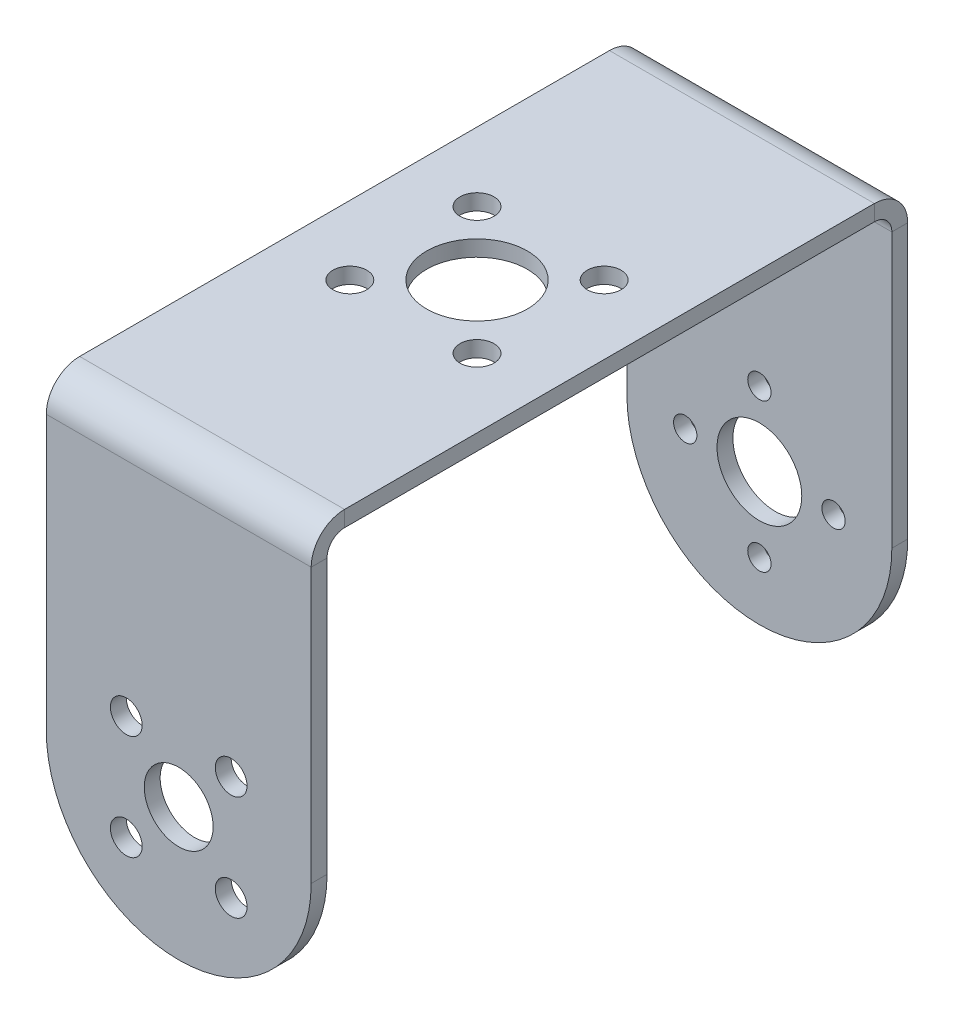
ISO-10303-21;
HEADER;
FILE_DESCRIPTION(('STEP AP214'),'2;1');
FILE_NAME('part.step','',(''),(''),'','','');
FILE_SCHEMA(('AUTOMOTIVE_DESIGN { 1 0 10303 214 1 1 1 1 }'));
ENDSEC;
DATA;
#1=APPLICATION_CONTEXT('core data for automotive mechanical design processes');
#2=APPLICATION_PROTOCOL_DEFINITION('international standard','automotive_design',2000,#1);
#3=PRODUCT_CONTEXT('',#1,'mechanical');
#4=PRODUCT('Part','Part','',(#3));
#5=PRODUCT_RELATED_PRODUCT_CATEGORY('part','',(#4));
#6=PRODUCT_DEFINITION_FORMATION('','',#4);
#7=PRODUCT_DEFINITION_CONTEXT('part definition',#1,'design');
#8=PRODUCT_DEFINITION('design','',#6,#7);
#9=PRODUCT_DEFINITION_SHAPE('','',#8);
#10=(LENGTH_UNIT() NAMED_UNIT(*) SI_UNIT(.MILLI.,.METRE.));
#11=(NAMED_UNIT(*) PLANE_ANGLE_UNIT() SI_UNIT($,.RADIAN.));
#12=(NAMED_UNIT(*) SI_UNIT($,.STERADIAN.) SOLID_ANGLE_UNIT());
#13=UNCERTAINTY_MEASURE_WITH_UNIT(LENGTH_MEASURE(1.E-05),#10,'distance_accuracy_value','');
#14=(GEOMETRIC_REPRESENTATION_CONTEXT(3) GLOBAL_UNCERTAINTY_ASSIGNED_CONTEXT((#13)) GLOBAL_UNIT_ASSIGNED_CONTEXT((#10,
#11,#12)) REPRESENTATION_CONTEXT('',''));
#15=CARTESIAN_POINT('',(0.,0.,0.));
#16=DIRECTION('',(0.,0.,1.));
#17=DIRECTION('',(1.,0.,0.));
#18=AXIS2_PLACEMENT_3D('',#15,#16,#17);
#19=CARTESIAN_POINT('',(0.,-1.5,0.));
#20=DIRECTION('',(0.,1.,0.));
#21=DIRECTION('',(0.,0.,1.));
#22=AXIS2_PLACEMENT_3D('',#19,#20,#21);
#23=PLANE('',#22);
#24=CARTESIAN_POINT('',(6.,-1.5,-6.));
#25=DIRECTION('',(0.,1.,0.));
#26=DIRECTION('',(0.,0.,1.));
#27=AXIS2_PLACEMENT_3D('',#24,#25,#26);
#28=CIRCLE('',#27,1.6);
#29=CARTESIAN_POINT('',(6.,-1.5,-4.4));
#30=VERTEX_POINT('',#29);
#31=EDGE_CURVE('E337',#30,#30,#28,.T.);
#32=ORIENTED_EDGE('',*,*,#31,.T.);
#33=EDGE_LOOP('',(#32));
#34=FACE_BOUND('',#33,.T.);
#35=CARTESIAN_POINT('',(6.,-1.5,6.));
#36=DIRECTION('',(0.,1.,0.));
#37=DIRECTION('',(0.,0.,1.));
#38=AXIS2_PLACEMENT_3D('',#35,#36,#37);
#39=CIRCLE('',#38,1.6);
#40=CARTESIAN_POINT('',(6.,-1.5,7.6));
#41=VERTEX_POINT('',#40);
#42=EDGE_CURVE('E344',#41,#41,#39,.T.);
#43=ORIENTED_EDGE('',*,*,#42,.T.);
#44=EDGE_LOOP('',(#43));
#45=FACE_BOUND('',#44,.T.);
#46=CARTESIAN_POINT('',(0.,-1.5,0.));
#47=DIRECTION('',(0.,1.,0.));
#48=DIRECTION('',(0.,0.,1.));
#49=AXIS2_PLACEMENT_3D('',#46,#47,#48);
#50=CIRCLE('',#49,4.75);
#51=CARTESIAN_POINT('',(0.,-1.5,4.75));
#52=VERTEX_POINT('',#51);
#53=EDGE_CURVE('E352',#52,#52,#50,.T.);
#54=ORIENTED_EDGE('',*,*,#53,.T.);
#55=EDGE_LOOP('',(#54));
#56=FACE_BOUND('',#55,.T.);
#57=CARTESIAN_POINT('',(-6.,-1.5,6.));
#58=DIRECTION('',(0.,1.,0.));
#59=DIRECTION('',(0.,0.,1.));
#60=AXIS2_PLACEMENT_3D('',#57,#58,#59);
#61=CIRCLE('',#60,1.6);
#62=CARTESIAN_POINT('',(-6.,-1.5,7.6));
#63=VERTEX_POINT('',#62);
#64=EDGE_CURVE('E1019',#63,#63,#61,.T.);
#65=ORIENTED_EDGE('',*,*,#64,.T.);
#66=EDGE_LOOP('',(#65));
#67=FACE_BOUND('',#66,.T.);
#68=CARTESIAN_POINT('',(-6.,-1.5,-6.));
#69=DIRECTION('',(0.,1.,0.));
#70=DIRECTION('',(0.,0.,1.));
#71=AXIS2_PLACEMENT_3D('',#68,#69,#70);
#72=CIRCLE('',#71,1.6);
#73=CARTESIAN_POINT('',(-6.,-1.5,-4.4));
#74=VERTEX_POINT('',#73);
#75=EDGE_CURVE('E1008',#74,#74,#72,.T.);
#76=ORIENTED_EDGE('',*,*,#75,.T.);
#77=EDGE_LOOP('',(#76));
#78=FACE_BOUND('',#77,.T.);
#79=DIRECTION('',(1.,0.,0.));
#80=VECTOR('',#79,1.);
#81=CARTESIAN_POINT('',(12.5,-1.50000000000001,-25.));
#82=LINE('',#81,#80);
#83=CARTESIAN_POINT('',(12.5,-1.50000000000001,-25.));
#84=VERTEX_POINT('',#83);
#85=CARTESIAN_POINT('',(-12.5,-1.50000000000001,-25.));
#86=VERTEX_POINT('',#85);
#87=EDGE_CURVE('E203',#84,#86,#82,.F.);
#88=ORIENTED_EDGE('',*,*,#87,.F.);
#89=DIRECTION('',(0.,0.,-1.));
#90=VECTOR('',#89,1.);
#91=CARTESIAN_POINT('',(12.5,-1.5,26.65));
#92=LINE('',#91,#90);
#93=CARTESIAN_POINT('',(12.5,-1.5,25.));
#94=VERTEX_POINT('',#93);
#95=EDGE_CURVE('E279',#94,#84,#92,.T.);
#96=ORIENTED_EDGE('',*,*,#95,.F.);
#97=DIRECTION('',(-1.,0.,0.));
#98=VECTOR('',#97,1.);
#99=CARTESIAN_POINT('',(-12.5,-1.5,25.));
#100=LINE('',#99,#98);
#101=CARTESIAN_POINT('',(-12.5,-1.5,25.));
#102=VERTEX_POINT('',#101);
#103=EDGE_CURVE('E261',#102,#94,#100,.F.);
#104=ORIENTED_EDGE('',*,*,#103,.F.);
#105=DIRECTION('',(0.,0.,1.));
#106=VECTOR('',#105,1.);
#107=CARTESIAN_POINT('',(-12.5,-1.5,26.65));
#108=LINE('',#107,#106);
#109=EDGE_CURVE('E275',#86,#102,#108,.T.);
#110=ORIENTED_EDGE('',*,*,#109,.F.);
#111=EDGE_LOOP('',(#88,#96,#104,#110));
#112=FACE_BOUND('',#111,.T.);
#113=ADVANCED_FACE('F46',(#34,#45,#56,#67,#78,#112),#23,.F.);
#114=CARTESIAN_POINT('',(0.,0.,0.));
#115=DIRECTION('',(0.,1.,0.));
#116=DIRECTION('',(0.,0.,1.));
#117=AXIS2_PLACEMENT_3D('',#114,#115,#116);
#118=PLANE('',#117);
#119=CARTESIAN_POINT('',(6.,0.,-6.));
#120=DIRECTION('',(0.,1.,0.));
#121=DIRECTION('',(0.,0.,1.));
#122=AXIS2_PLACEMENT_3D('',#119,#120,#121);
#123=CIRCLE('',#122,1.6);
#124=CARTESIAN_POINT('',(6.,0.,-4.4));
#125=VERTEX_POINT('',#124);
#126=EDGE_CURVE('E998',#125,#125,#123,.T.);
#127=ORIENTED_EDGE('',*,*,#126,.F.);
#128=EDGE_LOOP('',(#127));
#129=FACE_BOUND('',#128,.T.);
#130=CARTESIAN_POINT('',(6.,0.,6.));
#131=DIRECTION('',(0.,1.,0.));
#132=DIRECTION('',(0.,0.,1.));
#133=AXIS2_PLACEMENT_3D('',#130,#131,#132);
#134=CIRCLE('',#133,1.6);
#135=CARTESIAN_POINT('',(6.,0.,7.6));
#136=VERTEX_POINT('',#135);
#137=EDGE_CURVE('E1001',#136,#136,#134,.T.);
#138=ORIENTED_EDGE('',*,*,#137,.F.);
#139=EDGE_LOOP('',(#138));
#140=FACE_BOUND('',#139,.T.);
#141=CARTESIAN_POINT('',(0.,0.,0.));
#142=DIRECTION('',(0.,1.,0.));
#143=DIRECTION('',(0.,0.,1.));
#144=AXIS2_PLACEMENT_3D('',#141,#142,#143);
#145=CIRCLE('',#144,4.75);
#146=CARTESIAN_POINT('',(0.,0.,4.75));
#147=VERTEX_POINT('',#146);
#148=EDGE_CURVE('E1049',#147,#147,#145,.T.);
#149=ORIENTED_EDGE('',*,*,#148,.F.);
#150=EDGE_LOOP('',(#149));
#151=FACE_BOUND('',#150,.T.);
#152=CARTESIAN_POINT('',(-6.,0.,6.));
#153=DIRECTION('',(0.,1.,0.));
#154=DIRECTION('',(0.,0.,1.));
#155=AXIS2_PLACEMENT_3D('',#152,#153,#154);
#156=CIRCLE('',#155,1.6);
#157=CARTESIAN_POINT('',(-6.,0.,7.6));
#158=VERTEX_POINT('',#157);
#159=EDGE_CURVE('E1011',#158,#158,#156,.T.);
#160=ORIENTED_EDGE('',*,*,#159,.F.);
#161=EDGE_LOOP('',(#160));
#162=FACE_BOUND('',#161,.T.);
#163=CARTESIAN_POINT('',(-6.,0.,-6.));
#164=DIRECTION('',(0.,1.,0.));
#165=DIRECTION('',(0.,0.,1.));
#166=AXIS2_PLACEMENT_3D('',#163,#164,#165);
#167=CIRCLE('',#166,1.6);
#168=CARTESIAN_POINT('',(-6.,0.,-4.4));
#169=VERTEX_POINT('',#168);
#170=EDGE_CURVE('E1000',#169,#169,#167,.T.);
#171=ORIENTED_EDGE('',*,*,#170,.F.);
#172=EDGE_LOOP('',(#171));
#173=FACE_BOUND('',#172,.T.);
#174=DIRECTION('',(0.,0.,-1.));
#175=VECTOR('',#174,1.);
#176=CARTESIAN_POINT('',(12.5,0.,26.65));
#177=LINE('',#176,#175);
#178=CARTESIAN_POINT('',(12.5,0.,25.));
#179=VERTEX_POINT('',#178);
#180=CARTESIAN_POINT('',(12.5,0.,-25.));
#181=VERTEX_POINT('',#180);
#182=EDGE_CURVE('E280',#179,#181,#177,.T.);
#183=ORIENTED_EDGE('',*,*,#182,.T.);
#184=DIRECTION('',(1.,0.,0.));
#185=VECTOR('',#184,1.);
#186=CARTESIAN_POINT('',(12.5,0.,-25.));
#187=LINE('',#186,#185);
#188=CARTESIAN_POINT('',(-12.5,0.,-25.));
#189=VERTEX_POINT('',#188);
#190=EDGE_CURVE('E157',#181,#189,#187,.F.);
#191=ORIENTED_EDGE('',*,*,#190,.T.);
#192=DIRECTION('',(0.,0.,1.));
#193=VECTOR('',#192,1.);
#194=CARTESIAN_POINT('',(-12.5,0.,26.65));
#195=LINE('',#194,#193);
#196=CARTESIAN_POINT('',(-12.5,0.,25.));
#197=VERTEX_POINT('',#196);
#198=EDGE_CURVE('E271',#189,#197,#195,.T.);
#199=ORIENTED_EDGE('',*,*,#198,.T.);
#200=DIRECTION('',(-1.,0.,0.));
#201=VECTOR('',#200,1.);
#202=CARTESIAN_POINT('',(-12.5,0.,25.));
#203=LINE('',#202,#201);
#204=EDGE_CURVE('E244',#197,#179,#203,.F.);
#205=ORIENTED_EDGE('',*,*,#204,.T.);
#206=EDGE_LOOP('',(#183,#191,#199,#205));
#207=FACE_BOUND('',#206,.T.);
#208=ADVANCED_FACE('F467',(#129,#140,#151,#162,#173,#207),#118,.T.);
#209=CARTESIAN_POINT('',(12.5,-1.5,26.65));
#210=DIRECTION('',(1.,0.,0.));
#211=DIRECTION('',(0.,0.,-1.));
#212=AXIS2_PLACEMENT_3D('',#209,#210,#211);
#213=PLANE('',#212);
#214=ORIENTED_EDGE('',*,*,#95,.T.);
#215=DIRECTION('',(0.,1.,0.));
#216=VECTOR('',#215,1.);
#217=CARTESIAN_POINT('',(12.5,-1.50000000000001,-25.));
#218=LINE('',#217,#216);
#219=EDGE_CURVE('E198',#84,#181,#218,.T.);
#220=ORIENTED_EDGE('',*,*,#219,.T.);
#221=ORIENTED_EDGE('',*,*,#182,.F.);
#222=DIRECTION('',(0.,1.,0.));
#223=VECTOR('',#222,1.);
#224=CARTESIAN_POINT('',(12.5,-1.5,25.));
#225=LINE('',#224,#223);
#226=EDGE_CURVE('E267',#94,#179,#225,.T.);
#227=ORIENTED_EDGE('',*,*,#226,.F.);
#228=EDGE_LOOP('',(#214,#220,#221,#227));
#229=FACE_BOUND('',#228,.T.);
#230=ADVANCED_FACE('F472',(#229),#213,.T.);
#231=CARTESIAN_POINT('',(-12.5,-1.5,26.65));
#232=DIRECTION('',(-1.,0.,0.));
#233=DIRECTION('',(0.,0.,1.));
#234=AXIS2_PLACEMENT_3D('',#231,#232,#233);
#235=PLANE('',#234);
#236=DIRECTION('',(0.,1.,0.));
#237=VECTOR('',#236,1.);
#238=CARTESIAN_POINT('',(-12.5,-1.50000000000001,-25.));
#239=LINE('',#238,#237);
#240=EDGE_CURVE('E208',#86,#189,#239,.T.);
#241=ORIENTED_EDGE('',*,*,#240,.F.);
#242=ORIENTED_EDGE('',*,*,#109,.T.);
#243=DIRECTION('',(0.,1.,0.));
#244=VECTOR('',#243,1.);
#245=CARTESIAN_POINT('',(-12.5,-1.5,25.));
#246=LINE('',#245,#244);
#247=EDGE_CURVE('E253',#102,#197,#246,.T.);
#248=ORIENTED_EDGE('',*,*,#247,.T.);
#249=ORIENTED_EDGE('',*,*,#198,.F.);
#250=EDGE_LOOP('',(#241,#242,#248,#249));
#251=FACE_BOUND('',#250,.T.);
#252=ADVANCED_FACE('F482',(#251),#235,.T.);
#253=CARTESIAN_POINT('',(12.5,-3.15,25.));
#254=DIRECTION('',(1.,0.,0.));
#255=DIRECTION('',(0.,0.,-1.));
#256=AXIS2_PLACEMENT_3D('',#253,#254,#255);
#257=PLANE('',#256);
#258=DIRECTION('',(0.,0.,1.));
#259=VECTOR('',#258,1.);
#260=CARTESIAN_POINT('',(12.5,-3.15,26.65));
#261=LINE('',#260,#259);
#262=CARTESIAN_POINT('',(12.5,-3.14999999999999,26.65));
#263=VERTEX_POINT('',#262);
#264=CARTESIAN_POINT('',(12.5,-3.14999999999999,28.15));
#265=VERTEX_POINT('',#264);
#266=EDGE_CURVE('E212',#263,#265,#261,.T.);
#267=ORIENTED_EDGE('',*,*,#266,.F.);
#268=CARTESIAN_POINT('',(12.5,-3.15,25.));
#269=DIRECTION('',(-1.,0.,0.));
#270=DIRECTION('',(0.,0.,1.));
#271=AXIS2_PLACEMENT_3D('',#268,#269,#270);
#272=CIRCLE('',#271,1.65);
#273=EDGE_CURVE('E257',#94,#263,#272,.F.);
#274=ORIENTED_EDGE('',*,*,#273,.F.);
#275=ORIENTED_EDGE('',*,*,#226,.T.);
#276=CARTESIAN_POINT('',(12.5,-3.15,25.));
#277=DIRECTION('',(-1.,0.,0.));
#278=DIRECTION('',(0.,0.,1.));
#279=AXIS2_PLACEMENT_3D('',#276,#277,#278);
#280=CIRCLE('',#279,3.15);
#281=EDGE_CURVE('E248',#179,#265,#280,.F.);
#282=ORIENTED_EDGE('',*,*,#281,.T.);
#283=EDGE_LOOP('',(#267,#274,#275,#282));
#284=FACE_BOUND('',#283,.T.);
#285=ADVANCED_FACE('F486',(#284),#257,.T.);
#286=CARTESIAN_POINT('',(-12.5,-3.15,25.));
#287=DIRECTION('',(1.,0.,0.));
#288=DIRECTION('',(0.,0.,-1.));
#289=AXIS2_PLACEMENT_3D('',#286,#287,#288);
#290=PLANE('',#289);
#291=CARTESIAN_POINT('',(-12.5,-3.15,25.));
#292=DIRECTION('',(-1.,0.,0.));
#293=DIRECTION('',(0.,0.,1.));
#294=AXIS2_PLACEMENT_3D('',#291,#292,#293);
#295=CIRCLE('',#294,1.65);
#296=CARTESIAN_POINT('',(-12.5,-3.14999999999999,26.65));
#297=VERTEX_POINT('',#296);
#298=EDGE_CURVE('E238',#297,#102,#295,.T.);
#299=ORIENTED_EDGE('',*,*,#298,.F.);
#300=DIRECTION('',(0.,0.,1.));
#301=VECTOR('',#300,1.);
#302=CARTESIAN_POINT('',(-12.5,-3.15,26.65));
#303=LINE('',#302,#301);
#304=CARTESIAN_POINT('',(-12.5,-3.15,28.15));
#305=VERTEX_POINT('',#304);
#306=EDGE_CURVE('E218',#297,#305,#303,.T.);
#307=ORIENTED_EDGE('',*,*,#306,.T.);
#308=CARTESIAN_POINT('',(-12.5,-3.15,25.));
#309=DIRECTION('',(-1.,0.,0.));
#310=DIRECTION('',(0.,0.,1.));
#311=AXIS2_PLACEMENT_3D('',#308,#309,#310);
#312=CIRCLE('',#311,3.15);
#313=EDGE_CURVE('E249',#305,#197,#312,.T.);
#314=ORIENTED_EDGE('',*,*,#313,.T.);
#315=ORIENTED_EDGE('',*,*,#247,.F.);
#316=EDGE_LOOP('',(#299,#307,#314,#315));
#317=FACE_BOUND('',#316,.T.);
#318=ADVANCED_FACE('F477',(#317),#290,.F.);
#319=CARTESIAN_POINT('',(-12.5,-3.15,25.));
#320=DIRECTION('',(-1.,0.,0.));
#321=DIRECTION('',(0.,0.,1.));
#322=AXIS2_PLACEMENT_3D('',#319,#320,#321);
#323=CYLINDRICAL_SURFACE('',#322,3.15);
#324=ORIENTED_EDGE('',*,*,#204,.F.);
#325=ORIENTED_EDGE('',*,*,#313,.F.);
#326=DIRECTION('',(1.,0.,0.));
#327=VECTOR('',#326,1.);
#328=CARTESIAN_POINT('',(0.,-3.15,28.15));
#329=LINE('',#328,#327);
#330=EDGE_CURVE('E222',#305,#265,#329,.T.);
#331=ORIENTED_EDGE('',*,*,#330,.T.);
#332=ORIENTED_EDGE('',*,*,#281,.F.);
#333=EDGE_LOOP('',(#324,#325,#331,#332));
#334=FACE_BOUND('',#333,.T.);
#335=ADVANCED_FACE('F528',(#334),#323,.T.);
#336=CARTESIAN_POINT('',(-12.5,-3.15,25.));
#337=DIRECTION('',(-1.,0.,0.));
#338=DIRECTION('',(0.,0.,1.));
#339=AXIS2_PLACEMENT_3D('',#336,#337,#338);
#340=CYLINDRICAL_SURFACE('',#339,1.65);
#341=ORIENTED_EDGE('',*,*,#103,.T.);
#342=ORIENTED_EDGE('',*,*,#273,.T.);
#343=DIRECTION('',(-1.,0.,0.));
#344=VECTOR('',#343,1.);
#345=CARTESIAN_POINT('',(12.5,-3.15,26.65));
#346=LINE('',#345,#344);
#347=EDGE_CURVE('E215',#263,#297,#346,.T.);
#348=ORIENTED_EDGE('',*,*,#347,.T.);
#349=ORIENTED_EDGE('',*,*,#298,.T.);
#350=EDGE_LOOP('',(#341,#342,#348,#349));
#351=FACE_BOUND('',#350,.T.);
#352=ADVANCED_FACE('F516',(#351),#340,.F.);
#353=CARTESIAN_POINT('',(-12.5,-41.5,28.1500000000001));
#354=DIRECTION('',(1.,0.,0.));
#355=DIRECTION('',(0.,1.,0.));
#356=AXIS2_PLACEMENT_3D('',#353,#354,#355);
#357=PLANE('',#356);
#358=DIRECTION('',(0.,-1.,0.));
#359=VECTOR('',#358,1.);
#360=CARTESIAN_POINT('',(-12.5,-41.5,26.6500000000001));
#361=LINE('',#360,#359);
#362=CARTESIAN_POINT('',(-12.5,-29.,26.6500000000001));
#363=VERTEX_POINT('',#362);
#364=EDGE_CURVE('E229',#297,#363,#361,.T.);
#365=ORIENTED_EDGE('',*,*,#364,.T.);
#366=DIRECTION('',(0.,0.,-1.));
#367=VECTOR('',#366,1.);
#368=CARTESIAN_POINT('',(-12.5,-29.,28.1500000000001));
#369=LINE('',#368,#367);
#370=CARTESIAN_POINT('',(-12.5,-29.,28.1500000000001));
#371=VERTEX_POINT('',#370);
#372=EDGE_CURVE('E306',#363,#371,#369,.F.);
#373=ORIENTED_EDGE('',*,*,#372,.T.);
#374=DIRECTION('',(0.,-1.,0.));
#375=VECTOR('',#374,1.);
#376=CARTESIAN_POINT('',(-12.5,-41.5,28.1500000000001));
#377=LINE('',#376,#375);
#378=EDGE_CURVE('E230',#305,#371,#377,.T.);
#379=ORIENTED_EDGE('',*,*,#378,.F.);
#380=ORIENTED_EDGE('',*,*,#306,.F.);
#381=EDGE_LOOP('',(#365,#373,#379,#380));
#382=FACE_BOUND('',#381,.T.);
#383=ADVANCED_FACE('F524',(#382),#357,.F.);
#384=CARTESIAN_POINT('',(12.5,-1.49999999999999,28.15));
#385=DIRECTION('',(-1.,0.,0.));
#386=DIRECTION('',(0.,0.,1.));
#387=AXIS2_PLACEMENT_3D('',#384,#385,#386);
#388=PLANE('',#387);
#389=DIRECTION('',(0.,1.,0.));
#390=VECTOR('',#389,1.);
#391=CARTESIAN_POINT('',(12.5,-1.49999999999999,28.15));
#392=LINE('',#391,#390);
#393=CARTESIAN_POINT('',(12.5,-29.,28.1500000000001));
#394=VERTEX_POINT('',#393);
#395=EDGE_CURVE('E234',#394,#265,#392,.T.);
#396=ORIENTED_EDGE('',*,*,#395,.F.);
#397=DIRECTION('',(0.,0.,-1.));
#398=VECTOR('',#397,1.);
#399=CARTESIAN_POINT('',(12.5,-29.,28.1500000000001));
#400=LINE('',#399,#398);
#401=CARTESIAN_POINT('',(12.5,-29.,26.6500000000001));
#402=VERTEX_POINT('',#401);
#403=EDGE_CURVE('E284',#394,#402,#400,.T.);
#404=ORIENTED_EDGE('',*,*,#403,.T.);
#405=DIRECTION('',(0.,1.,0.));
#406=VECTOR('',#405,1.);
#407=CARTESIAN_POINT('',(12.5,-1.5,26.65));
#408=LINE('',#407,#406);
#409=EDGE_CURVE('E235',#402,#263,#408,.T.);
#410=ORIENTED_EDGE('',*,*,#409,.T.);
#411=ORIENTED_EDGE('',*,*,#266,.T.);
#412=EDGE_LOOP('',(#396,#404,#410,#411));
#413=FACE_BOUND('',#412,.T.);
#414=ADVANCED_FACE('F508',(#413),#388,.F.);
#415=CARTESIAN_POINT('',(0.,0.,28.15));
#416=DIRECTION('',(0.,0.,-1.));
#417=DIRECTION('',(0.,1.,0.));
#418=AXIS2_PLACEMENT_3D('',#415,#416,#417);
#419=PLANE('',#418);
#420=CARTESIAN_POINT('',(4.94974746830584,-24.0502525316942,28.15));
#421=DIRECTION('',(0.,0.,1.));
#422=DIRECTION('',(1.,0.,0.));
#423=AXIS2_PLACEMENT_3D('',#420,#421,#422);
#424=CIRCLE('',#423,1.5);
#425=CARTESIAN_POINT('',(6.44974746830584,-24.0502525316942,28.15));
#426=VERTEX_POINT('',#425);
#427=EDGE_CURVE('E408',#426,#426,#424,.T.);
#428=ORIENTED_EDGE('',*,*,#427,.F.);
#429=EDGE_LOOP('',(#428));
#430=FACE_BOUND('',#429,.T.);
#431=CARTESIAN_POINT('',(-4.94974746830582,-33.9497474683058,28.15));
#432=DIRECTION('',(0.,0.,1.));
#433=DIRECTION('',(1.,0.,0.));
#434=AXIS2_PLACEMENT_3D('',#431,#432,#433);
#435=CIRCLE('',#434,1.5);
#436=CARTESIAN_POINT('',(-3.44974746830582,-33.9497474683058,28.15));
#437=VERTEX_POINT('',#436);
#438=EDGE_CURVE('E401',#437,#437,#435,.T.);
#439=ORIENTED_EDGE('',*,*,#438,.F.);
#440=EDGE_LOOP('',(#439));
#441=FACE_BOUND('',#440,.T.);
#442=CARTESIAN_POINT('',(4.94974746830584,-33.9497474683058,28.15));
#443=DIRECTION('',(0.,0.,1.));
#444=DIRECTION('',(1.,0.,0.));
#445=AXIS2_PLACEMENT_3D('',#442,#443,#444);
#446=CIRCLE('',#445,1.5);
#447=CARTESIAN_POINT('',(6.44974746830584,-33.9497474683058,28.15));
#448=VERTEX_POINT('',#447);
#449=EDGE_CURVE('E392',#448,#448,#446,.T.);
#450=ORIENTED_EDGE('',*,*,#449,.F.);
#451=EDGE_LOOP('',(#450));
#452=FACE_BOUND('',#451,.T.);
#453=CARTESIAN_POINT('',(0.,-29.,28.15));
#454=DIRECTION('',(0.,0.,1.));
#455=DIRECTION('',(1.,0.,0.));
#456=AXIS2_PLACEMENT_3D('',#453,#454,#455);
#457=CIRCLE('',#456,3.25);
#458=CARTESIAN_POINT('',(3.25000000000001,-29.,28.15));
#459=VERTEX_POINT('',#458);
#460=EDGE_CURVE('E388',#459,#459,#457,.T.);
#461=ORIENTED_EDGE('',*,*,#460,.F.);
#462=EDGE_LOOP('',(#461));
#463=FACE_BOUND('',#462,.T.);
#464=CARTESIAN_POINT('',(-4.94974746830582,-24.0502525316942,28.15));
#465=DIRECTION('',(0.,0.,1.));
#466=DIRECTION('',(1.,0.,0.));
#467=AXIS2_PLACEMENT_3D('',#464,#465,#466);
#468=CIRCLE('',#467,1.5);
#469=CARTESIAN_POINT('',(-3.44974746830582,-24.0502525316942,28.15));
#470=VERTEX_POINT('',#469);
#471=EDGE_CURVE('E427',#470,#470,#468,.T.);
#472=ORIENTED_EDGE('',*,*,#471,.F.);
#473=EDGE_LOOP('',(#472));
#474=FACE_BOUND('',#473,.T.);
#475=CARTESIAN_POINT('',(0.,-29.,28.1500000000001));
#476=DIRECTION('',(0.,0.,-1.));
#477=DIRECTION('',(0.,1.,0.));
#478=AXIS2_PLACEMENT_3D('',#475,#476,#477);
#479=CIRCLE('',#478,12.5);
#480=CARTESIAN_POINT('',(0.,-41.5,28.1500000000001));
#481=VERTEX_POINT('',#480);
#482=EDGE_CURVE('E300',#371,#481,#479,.F.);
#483=ORIENTED_EDGE('',*,*,#482,.T.);
#484=CARTESIAN_POINT('',(0.,-29.,28.1500000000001));
#485=DIRECTION('',(0.,0.,-1.));
#486=DIRECTION('',(0.,1.,0.));
#487=AXIS2_PLACEMENT_3D('',#484,#485,#486);
#488=CIRCLE('',#487,12.5);
#489=EDGE_CURVE('E303',#481,#394,#488,.F.);
#490=ORIENTED_EDGE('',*,*,#489,.T.);
#491=ORIENTED_EDGE('',*,*,#395,.T.);
#492=ORIENTED_EDGE('',*,*,#330,.F.);
#493=ORIENTED_EDGE('',*,*,#378,.T.);
#494=EDGE_LOOP('',(#483,#490,#491,#492,#493));
#495=FACE_BOUND('',#494,.T.);
#496=ADVANCED_FACE('F505',(#430,#441,#452,#463,#474,#495),#419,.F.);
#497=CARTESIAN_POINT('',(0.,0.,26.65));
#498=DIRECTION('',(0.,0.,-1.));
#499=DIRECTION('',(0.,1.,0.));
#500=AXIS2_PLACEMENT_3D('',#497,#498,#499);
#501=PLANE('',#500);
#502=CARTESIAN_POINT('',(4.94974746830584,-24.0502525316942,26.6500000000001));
#503=DIRECTION('',(0.,0.,-1.));
#504=DIRECTION('',(0.,1.,0.));
#505=AXIS2_PLACEMENT_3D('',#502,#503,#504);
#506=CIRCLE('',#505,1.5);
#507=CARTESIAN_POINT('',(6.44974746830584,-24.0502525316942,26.6500000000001));
#508=VERTEX_POINT('',#507);
#509=EDGE_CURVE('E412',#508,#508,#506,.F.);
#510=ORIENTED_EDGE('',*,*,#509,.T.);
#511=EDGE_LOOP('',(#510));
#512=FACE_BOUND('',#511,.T.);
#513=CARTESIAN_POINT('',(-4.94974746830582,-33.9497474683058,26.6500000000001));
#514=DIRECTION('',(0.,0.,-1.));
#515=DIRECTION('',(0.,1.,0.));
#516=AXIS2_PLACEMENT_3D('',#513,#514,#515);
#517=CIRCLE('',#516,1.5);
#518=CARTESIAN_POINT('',(-3.44974746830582,-33.9497474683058,26.6500000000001));
#519=VERTEX_POINT('',#518);
#520=EDGE_CURVE('E413',#519,#519,#517,.F.);
#521=ORIENTED_EDGE('',*,*,#520,.T.);
#522=EDGE_LOOP('',(#521));
#523=FACE_BOUND('',#522,.T.);
#524=CARTESIAN_POINT('',(4.94974746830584,-33.9497474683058,26.6500000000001));
#525=DIRECTION('',(0.,0.,-1.));
#526=DIRECTION('',(0.,1.,0.));
#527=AXIS2_PLACEMENT_3D('',#524,#525,#526);
#528=CIRCLE('',#527,1.5);
#529=CARTESIAN_POINT('',(6.44974746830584,-33.9497474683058,26.6500000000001));
#530=VERTEX_POINT('',#529);
#531=EDGE_CURVE('E396',#530,#530,#528,.F.);
#532=ORIENTED_EDGE('',*,*,#531,.T.);
#533=EDGE_LOOP('',(#532));
#534=FACE_BOUND('',#533,.T.);
#535=CARTESIAN_POINT('',(0.,-29.,26.6500000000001));
#536=DIRECTION('',(0.,0.,-1.));
#537=DIRECTION('',(0.,1.,0.));
#538=AXIS2_PLACEMENT_3D('',#535,#536,#537);
#539=CIRCLE('',#538,3.25);
#540=CARTESIAN_POINT('',(3.25000000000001,-29.,26.6500000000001));
#541=VERTEX_POINT('',#540);
#542=EDGE_CURVE('E397',#541,#541,#539,.F.);
#543=ORIENTED_EDGE('',*,*,#542,.T.);
#544=EDGE_LOOP('',(#543));
#545=FACE_BOUND('',#544,.T.);
#546=CARTESIAN_POINT('',(-4.94974746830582,-24.0502525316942,26.6500000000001));
#547=DIRECTION('',(0.,0.,-1.));
#548=DIRECTION('',(0.,1.,0.));
#549=AXIS2_PLACEMENT_3D('',#546,#547,#548);
#550=CIRCLE('',#549,1.5);
#551=CARTESIAN_POINT('',(-3.44974746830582,-24.0502525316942,26.6500000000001));
#552=VERTEX_POINT('',#551);
#553=EDGE_CURVE('E417',#552,#552,#550,.F.);
#554=ORIENTED_EDGE('',*,*,#553,.T.);
#555=EDGE_LOOP('',(#554));
#556=FACE_BOUND('',#555,.T.);
#557=ORIENTED_EDGE('',*,*,#409,.F.);
#558=CARTESIAN_POINT('',(0.,-29.,26.6500000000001));
#559=DIRECTION('',(0.,0.,-1.));
#560=DIRECTION('',(0.,1.,0.));
#561=AXIS2_PLACEMENT_3D('',#558,#559,#560);
#562=CIRCLE('',#561,12.5);
#563=CARTESIAN_POINT('',(0.,-41.5,26.6500000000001));
#564=VERTEX_POINT('',#563);
#565=EDGE_CURVE('E297',#402,#564,#562,.T.);
#566=ORIENTED_EDGE('',*,*,#565,.T.);
#567=CARTESIAN_POINT('',(0.,-29.,26.6500000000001));
#568=DIRECTION('',(0.,0.,-1.));
#569=DIRECTION('',(0.,1.,0.));
#570=AXIS2_PLACEMENT_3D('',#567,#568,#569);
#571=CIRCLE('',#570,12.5);
#572=EDGE_CURVE('E294',#564,#363,#571,.T.);
#573=ORIENTED_EDGE('',*,*,#572,.T.);
#574=ORIENTED_EDGE('',*,*,#364,.F.);
#575=ORIENTED_EDGE('',*,*,#347,.F.);
#576=EDGE_LOOP('',(#557,#566,#573,#574,#575));
#577=FACE_BOUND('',#576,.T.);
#578=ADVANCED_FACE('F521',(#512,#523,#534,#545,#556,#577),#501,.T.);
#579=CARTESIAN_POINT('',(-12.5,-3.15000000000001,-25.));
#580=DIRECTION('',(-1.,0.,0.));
#581=DIRECTION('',(0.,0.,1.));
#582=AXIS2_PLACEMENT_3D('',#579,#580,#581);
#583=PLANE('',#582);
#584=DIRECTION('',(0.,0.,-1.));
#585=VECTOR('',#584,1.);
#586=CARTESIAN_POINT('',(-12.5,-3.15,-26.65));
#587=LINE('',#586,#585);
#588=CARTESIAN_POINT('',(-12.5,-3.15,-26.65));
#589=VERTEX_POINT('',#588);
#590=CARTESIAN_POINT('',(-12.5,-3.15,-28.15));
#591=VERTEX_POINT('',#590);
#592=EDGE_CURVE('E431',#589,#591,#587,.T.);
#593=ORIENTED_EDGE('',*,*,#592,.F.);
#594=CARTESIAN_POINT('',(-12.5,-3.15000000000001,-25.));
#595=DIRECTION('',(1.,0.,0.));
#596=DIRECTION('',(0.,0.,-1.));
#597=AXIS2_PLACEMENT_3D('',#594,#595,#596);
#598=CIRCLE('',#597,1.65);
#599=EDGE_CURVE('E161',#86,#589,#598,.F.);
#600=ORIENTED_EDGE('',*,*,#599,.F.);
#601=ORIENTED_EDGE('',*,*,#240,.T.);
#602=CARTESIAN_POINT('',(-12.5,-3.15000000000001,-25.));
#603=DIRECTION('',(1.,0.,0.));
#604=DIRECTION('',(0.,0.,-1.));
#605=AXIS2_PLACEMENT_3D('',#602,#603,#604);
#606=CIRCLE('',#605,3.15);
#607=EDGE_CURVE('E196',#189,#591,#606,.F.);
#608=ORIENTED_EDGE('',*,*,#607,.T.);
#609=EDGE_LOOP('',(#593,#600,#601,#608));
#610=FACE_BOUND('',#609,.T.);
#611=ADVANCED_FACE('F444',(#610),#583,.T.);
#612=CARTESIAN_POINT('',(12.5,-3.15000000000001,-25.));
#613=DIRECTION('',(-1.,0.,0.));
#614=DIRECTION('',(0.,0.,1.));
#615=AXIS2_PLACEMENT_3D('',#612,#613,#614);
#616=PLANE('',#615);
#617=CARTESIAN_POINT('',(12.5,-3.15000000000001,-25.));
#618=DIRECTION('',(1.,0.,0.));
#619=DIRECTION('',(0.,0.,-1.));
#620=AXIS2_PLACEMENT_3D('',#617,#618,#619);
#621=CIRCLE('',#620,1.65);
#622=CARTESIAN_POINT('',(12.5,-3.15,-26.65));
#623=VERTEX_POINT('',#622);
#624=EDGE_CURVE('E168',#623,#84,#621,.T.);
#625=ORIENTED_EDGE('',*,*,#624,.F.);
#626=DIRECTION('',(0.,0.,-1.));
#627=VECTOR('',#626,1.);
#628=CARTESIAN_POINT('',(12.5,-3.15,-26.65));
#629=LINE('',#628,#627);
#630=CARTESIAN_POINT('',(12.5,-3.14999999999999,-28.15));
#631=VERTEX_POINT('',#630);
#632=EDGE_CURVE('E165',#623,#631,#629,.T.);
#633=ORIENTED_EDGE('',*,*,#632,.T.);
#634=CARTESIAN_POINT('',(12.5,-3.15000000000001,-25.));
#635=DIRECTION('',(1.,0.,0.));
#636=DIRECTION('',(0.,0.,-1.));
#637=AXIS2_PLACEMENT_3D('',#634,#635,#636);
#638=CIRCLE('',#637,3.15);
#639=EDGE_CURVE('E150',#631,#181,#638,.T.);
#640=ORIENTED_EDGE('',*,*,#639,.T.);
#641=ORIENTED_EDGE('',*,*,#219,.F.);
#642=EDGE_LOOP('',(#625,#633,#640,#641));
#643=FACE_BOUND('',#642,.T.);
#644=ADVANCED_FACE('F166',(#643),#616,.F.);
#645=CARTESIAN_POINT('',(12.5,-3.15000000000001,-25.));
#646=DIRECTION('',(1.,0.,0.));
#647=DIRECTION('',(0.,0.,-1.));
#648=AXIS2_PLACEMENT_3D('',#645,#646,#647);
#649=CYLINDRICAL_SURFACE('',#648,3.15);
#650=ORIENTED_EDGE('',*,*,#190,.F.);
#651=ORIENTED_EDGE('',*,*,#639,.F.);
#652=DIRECTION('',(-1.,0.,0.));
#653=VECTOR('',#652,1.);
#654=CARTESIAN_POINT('',(0.,-3.14999999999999,-28.15));
#655=LINE('',#654,#653);
#656=EDGE_CURVE('E154',#631,#591,#655,.T.);
#657=ORIENTED_EDGE('',*,*,#656,.T.);
#658=ORIENTED_EDGE('',*,*,#607,.F.);
#659=EDGE_LOOP('',(#650,#651,#657,#658));
#660=FACE_BOUND('',#659,.T.);
#661=ADVANCED_FACE('F152',(#660),#649,.T.);
#662=CARTESIAN_POINT('',(12.5,-3.15000000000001,-25.));
#663=DIRECTION('',(1.,0.,0.));
#664=DIRECTION('',(0.,0.,-1.));
#665=AXIS2_PLACEMENT_3D('',#662,#663,#664);
#666=CYLINDRICAL_SURFACE('',#665,1.65);
#667=ORIENTED_EDGE('',*,*,#87,.T.);
#668=ORIENTED_EDGE('',*,*,#599,.T.);
#669=DIRECTION('',(1.,0.,0.));
#670=VECTOR('',#669,1.);
#671=CARTESIAN_POINT('',(-12.5,-3.15,-26.65));
#672=LINE('',#671,#670);
#673=EDGE_CURVE('E171',#589,#623,#672,.T.);
#674=ORIENTED_EDGE('',*,*,#673,.T.);
#675=ORIENTED_EDGE('',*,*,#624,.T.);
#676=EDGE_LOOP('',(#667,#668,#674,#675));
#677=FACE_BOUND('',#676,.T.);
#678=ADVANCED_FACE('F448',(#677),#666,.F.);
#679=CARTESIAN_POINT('',(12.5,-41.5,-28.1500000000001));
#680=DIRECTION('',(-1.,0.,0.));
#681=DIRECTION('',(0.,0.,1.));
#682=AXIS2_PLACEMENT_3D('',#679,#680,#681);
#683=PLANE('',#682);
#684=DIRECTION('',(0.,-1.,0.));
#685=VECTOR('',#684,1.);
#686=CARTESIAN_POINT('',(12.5,-41.5,-26.6500000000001));
#687=LINE('',#686,#685);
#688=CARTESIAN_POINT('',(12.5,-29.,-26.6500000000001));
#689=VERTEX_POINT('',#688);
#690=EDGE_CURVE('E178',#623,#689,#687,.T.);
#691=ORIENTED_EDGE('',*,*,#690,.T.);
#692=DIRECTION('',(0.,0.,1.));
#693=VECTOR('',#692,1.);
#694=CARTESIAN_POINT('',(12.5,-29.,-28.1500000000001));
#695=LINE('',#694,#693);
#696=CARTESIAN_POINT('',(12.5,-29.,-28.1500000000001));
#697=VERTEX_POINT('',#696);
#698=EDGE_CURVE('E11',#689,#697,#695,.F.);
#699=ORIENTED_EDGE('',*,*,#698,.T.);
#700=DIRECTION('',(0.,-1.,0.));
#701=VECTOR('',#700,1.);
#702=CARTESIAN_POINT('',(12.5,-41.5,-28.1500000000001));
#703=LINE('',#702,#701);
#704=EDGE_CURVE('E174',#631,#697,#703,.T.);
#705=ORIENTED_EDGE('',*,*,#704,.F.);
#706=ORIENTED_EDGE('',*,*,#632,.F.);
#707=EDGE_LOOP('',(#691,#699,#705,#706));
#708=FACE_BOUND('',#707,.T.);
#709=ADVANCED_FACE('F180',(#708),#683,.F.);
#710=CARTESIAN_POINT('',(-12.5,-1.49999999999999,-28.15));
#711=DIRECTION('',(1.,0.,0.));
#712=DIRECTION('',(0.,0.,-1.));
#713=AXIS2_PLACEMENT_3D('',#710,#711,#712);
#714=PLANE('',#713);
#715=DIRECTION('',(0.,1.,0.));
#716=VECTOR('',#715,1.);
#717=CARTESIAN_POINT('',(-12.5,-1.49999999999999,-28.15));
#718=LINE('',#717,#716);
#719=CARTESIAN_POINT('',(-12.5,-29.,-28.1500000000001));
#720=VERTEX_POINT('',#719);
#721=EDGE_CURVE('E176',#720,#591,#718,.T.);
#722=ORIENTED_EDGE('',*,*,#721,.F.);
#723=DIRECTION('',(0.,0.,1.));
#724=VECTOR('',#723,1.);
#725=CARTESIAN_POINT('',(-12.5,-29.,-28.1500000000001));
#726=LINE('',#725,#724);
#727=CARTESIAN_POINT('',(-12.5,-29.,-26.6500000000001));
#728=VERTEX_POINT('',#727);
#729=EDGE_CURVE('E309',#720,#728,#726,.T.);
#730=ORIENTED_EDGE('',*,*,#729,.T.);
#731=DIRECTION('',(0.,1.,0.));
#732=VECTOR('',#731,1.);
#733=CARTESIAN_POINT('',(-12.5,-1.5,-26.65));
#734=LINE('',#733,#732);
#735=EDGE_CURVE('E182',#728,#589,#734,.T.);
#736=ORIENTED_EDGE('',*,*,#735,.T.);
#737=ORIENTED_EDGE('',*,*,#592,.T.);
#738=EDGE_LOOP('',(#722,#730,#736,#737));
#739=FACE_BOUND('',#738,.T.);
#740=ADVANCED_FACE('F439',(#739),#714,.F.);
#741=CARTESIAN_POINT('',(0.,0.,-28.15));
#742=DIRECTION('',(0.,0.,1.));
#743=DIRECTION('',(0.,-1.,0.));
#744=AXIS2_PLACEMENT_3D('',#741,#742,#743);
#745=PLANE('',#744);
#746=CARTESIAN_POINT('',(0.,-35.9999999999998,-28.1500000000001));
#747=DIRECTION('',(0.,0.,-1.));
#748=DIRECTION('',(0.,1.,0.));
#749=AXIS2_PLACEMENT_3D('',#746,#747,#748);
#750=CIRCLE('',#749,1.1);
#751=CARTESIAN_POINT('',(0.,-34.8999999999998,-28.1500000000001));
#752=VERTEX_POINT('',#751);
#753=EDGE_CURVE('E373',#752,#752,#750,.T.);
#754=ORIENTED_EDGE('',*,*,#753,.F.);
#755=EDGE_LOOP('',(#754));
#756=FACE_BOUND('',#755,.T.);
#757=CARTESIAN_POINT('',(-7.,-28.9999999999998,-28.1500000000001));
#758=DIRECTION('',(0.,0.,-1.));
#759=DIRECTION('',(0.,1.,0.));
#760=AXIS2_PLACEMENT_3D('',#757,#758,#759);
#761=CIRCLE('',#760,1.1);
#762=CARTESIAN_POINT('',(-7.,-27.8999999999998,-28.1500000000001));
#763=VERTEX_POINT('',#762);
#764=EDGE_CURVE('E360',#763,#763,#761,.T.);
#765=ORIENTED_EDGE('',*,*,#764,.F.);
#766=EDGE_LOOP('',(#765));
#767=FACE_BOUND('',#766,.T.);
#768=CARTESIAN_POINT('',(7.00000000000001,-28.9999999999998,-28.1500000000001));
#769=DIRECTION('',(0.,0.,-1.));
#770=DIRECTION('',(0.,1.,0.));
#771=AXIS2_PLACEMENT_3D('',#768,#769,#770);
#772=CIRCLE('',#771,1.1);
#773=CARTESIAN_POINT('',(7.00000000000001,-27.8999999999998,-28.1500000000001));
#774=VERTEX_POINT('',#773);
#775=EDGE_CURVE('E361',#774,#774,#772,.T.);
#776=ORIENTED_EDGE('',*,*,#775,.F.);
#777=EDGE_LOOP('',(#776));
#778=FACE_BOUND('',#777,.T.);
#779=CARTESIAN_POINT('',(0.,-21.9999999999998,-28.1500000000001));
#780=DIRECTION('',(0.,0.,-1.));
#781=DIRECTION('',(0.,1.,0.));
#782=AXIS2_PLACEMENT_3D('',#779,#780,#781);
#783=CIRCLE('',#782,1.1);
#784=CARTESIAN_POINT('',(0.,-20.8999999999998,-28.1500000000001));
#785=VERTEX_POINT('',#784);
#786=EDGE_CURVE('E325',#785,#785,#783,.T.);
#787=ORIENTED_EDGE('',*,*,#786,.F.);
#788=EDGE_LOOP('',(#787));
#789=FACE_BOUND('',#788,.T.);
#790=CARTESIAN_POINT('',(0.,-28.9999999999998,-28.1500000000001));
#791=DIRECTION('',(0.,0.,-1.));
#792=DIRECTION('',(0.,1.,0.));
#793=AXIS2_PLACEMENT_3D('',#790,#791,#792);
#794=CIRCLE('',#793,3.99999999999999);
#795=CARTESIAN_POINT('',(0.,-24.9999999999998,-28.1500000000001));
#796=VERTEX_POINT('',#795);
#797=EDGE_CURVE('E384',#796,#796,#794,.T.);
#798=ORIENTED_EDGE('',*,*,#797,.F.);
#799=EDGE_LOOP('',(#798));
#800=FACE_BOUND('',#799,.T.);
#801=CARTESIAN_POINT('',(0.,-29.,-28.1500000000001));
#802=DIRECTION('',(0.,0.,1.));
#803=DIRECTION('',(0.,-1.,0.));
#804=AXIS2_PLACEMENT_3D('',#801,#802,#803);
#805=CIRCLE('',#804,12.5);
#806=CARTESIAN_POINT('',(0.,-41.5,-28.1500000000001));
#807=VERTEX_POINT('',#806);
#808=EDGE_CURVE('E64',#697,#807,#805,.F.);
#809=ORIENTED_EDGE('',*,*,#808,.T.);
#810=CARTESIAN_POINT('',(0.,-29.,-28.1500000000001));
#811=DIRECTION('',(0.,0.,1.));
#812=DIRECTION('',(0.,-1.,0.));
#813=AXIS2_PLACEMENT_3D('',#810,#811,#812);
#814=CIRCLE('',#813,12.5);
#815=EDGE_CURVE('E56',#807,#720,#814,.F.);
#816=ORIENTED_EDGE('',*,*,#815,.T.);
#817=ORIENTED_EDGE('',*,*,#721,.T.);
#818=ORIENTED_EDGE('',*,*,#656,.F.);
#819=ORIENTED_EDGE('',*,*,#704,.T.);
#820=EDGE_LOOP('',(#809,#816,#817,#818,#819));
#821=FACE_BOUND('',#820,.T.);
#822=ADVANCED_FACE('F173',(#756,#767,#778,#789,#800,#821),#745,.F.);
#823=CARTESIAN_POINT('',(0.,0.,-26.65));
#824=DIRECTION('',(0.,0.,1.));
#825=DIRECTION('',(0.,-1.,0.));
#826=AXIS2_PLACEMENT_3D('',#823,#824,#825);
#827=PLANE('',#826);
#828=CARTESIAN_POINT('',(0.,-35.9999999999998,-26.6500000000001));
#829=DIRECTION('',(0.,0.,1.));
#830=DIRECTION('',(0.,-1.,0.));
#831=AXIS2_PLACEMENT_3D('',#828,#829,#830);
#832=CIRCLE('',#831,1.1);
#833=CARTESIAN_POINT('',(0.,-37.0999999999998,-26.6500000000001));
#834=VERTEX_POINT('',#833);
#835=EDGE_CURVE('E368',#834,#834,#832,.F.);
#836=ORIENTED_EDGE('',*,*,#835,.T.);
#837=EDGE_LOOP('',(#836));
#838=FACE_BOUND('',#837,.T.);
#839=CARTESIAN_POINT('',(-7.,-28.9999999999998,-26.6500000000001));
#840=DIRECTION('',(0.,0.,1.));
#841=DIRECTION('',(0.,-1.,0.));
#842=AXIS2_PLACEMENT_3D('',#839,#840,#841);
#843=CIRCLE('',#842,1.1);
#844=CARTESIAN_POINT('',(-7.,-30.0999999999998,-26.6500000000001));
#845=VERTEX_POINT('',#844);
#846=EDGE_CURVE('E377',#845,#845,#843,.F.);
#847=ORIENTED_EDGE('',*,*,#846,.T.);
#848=EDGE_LOOP('',(#847));
#849=FACE_BOUND('',#848,.T.);
#850=CARTESIAN_POINT('',(7.00000000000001,-28.9999999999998,-26.6500000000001));
#851=DIRECTION('',(0.,0.,1.));
#852=DIRECTION('',(0.,-1.,0.));
#853=AXIS2_PLACEMENT_3D('',#850,#851,#852);
#854=CIRCLE('',#853,1.1);
#855=CARTESIAN_POINT('',(7.00000000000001,-30.0999999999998,-26.6500000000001));
#856=VERTEX_POINT('',#855);
#857=EDGE_CURVE('E356',#856,#856,#854,.F.);
#858=ORIENTED_EDGE('',*,*,#857,.T.);
#859=EDGE_LOOP('',(#858));
#860=FACE_BOUND('',#859,.T.);
#861=CARTESIAN_POINT('',(0.,-21.9999999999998,-26.6500000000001));
#862=DIRECTION('',(0.,0.,1.));
#863=DIRECTION('',(0.,-1.,0.));
#864=AXIS2_PLACEMENT_3D('',#861,#862,#863);
#865=CIRCLE('',#864,1.1);
#866=CARTESIAN_POINT('',(0.,-23.0999999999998,-26.6500000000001));
#867=VERTEX_POINT('',#866);
#868=EDGE_CURVE('E334',#867,#867,#865,.F.);
#869=ORIENTED_EDGE('',*,*,#868,.T.);
#870=EDGE_LOOP('',(#869));
#871=FACE_BOUND('',#870,.T.);
#872=CARTESIAN_POINT('',(0.,-28.9999999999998,-26.6500000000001));
#873=DIRECTION('',(0.,0.,1.));
#874=DIRECTION('',(0.,-1.,0.));
#875=AXIS2_PLACEMENT_3D('',#872,#873,#874);
#876=CIRCLE('',#875,3.99999999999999);
#877=CARTESIAN_POINT('',(0.,-32.9999999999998,-26.6500000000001));
#878=VERTEX_POINT('',#877);
#879=EDGE_CURVE('E372',#878,#878,#876,.F.);
#880=ORIENTED_EDGE('',*,*,#879,.T.);
#881=EDGE_LOOP('',(#880));
#882=FACE_BOUND('',#881,.T.);
#883=ORIENTED_EDGE('',*,*,#735,.F.);
#884=CARTESIAN_POINT('',(0.,-29.,-26.6500000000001));
#885=DIRECTION('',(0.,0.,1.));
#886=DIRECTION('',(0.,-1.,0.));
#887=AXIS2_PLACEMENT_3D('',#884,#885,#886);
#888=CIRCLE('',#887,12.5);
#889=CARTESIAN_POINT('',(0.,-41.5,-26.6500000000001));
#890=VERTEX_POINT('',#889);
#891=EDGE_CURVE('E316',#728,#890,#888,.T.);
#892=ORIENTED_EDGE('',*,*,#891,.T.);
#893=CARTESIAN_POINT('',(0.,-29.,-26.6500000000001));
#894=DIRECTION('',(0.,0.,1.));
#895=DIRECTION('',(0.,-1.,0.));
#896=AXIS2_PLACEMENT_3D('',#893,#894,#895);
#897=CIRCLE('',#896,12.5);
#898=EDGE_CURVE('E313',#890,#689,#897,.T.);
#899=ORIENTED_EDGE('',*,*,#898,.T.);
#900=ORIENTED_EDGE('',*,*,#690,.F.);
#901=ORIENTED_EDGE('',*,*,#673,.F.);
#902=EDGE_LOOP('',(#883,#892,#899,#900,#901));
#903=FACE_BOUND('',#902,.T.);
#904=ADVANCED_FACE('F451',(#838,#849,#860,#871,#882,#903),#827,.T.);
#905=CARTESIAN_POINT('',(-4.94974746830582,-24.0502525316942,-28.1510000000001));
#906=DIRECTION('',(0.,0.,1.));
#907=DIRECTION('',(1.,0.,0.));
#908=AXIS2_PLACEMENT_3D('',#905,#906,#907);
#909=CYLINDRICAL_SURFACE('',#908,1.5);
#910=CARTESIAN_POINT('',(-3.44974746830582,-24.0502525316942,26.6500000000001));
#911=CARTESIAN_POINT('',(-3.44974746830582,-24.0502525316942,26.6656250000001));
#912=CARTESIAN_POINT('',(-3.44974746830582,-24.0502525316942,26.6812500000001));
#913=CARTESIAN_POINT('',(-3.44974746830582,-24.0502525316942,26.7125000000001));
#914=CARTESIAN_POINT('',(-3.44974746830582,-24.0502525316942,26.7281250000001));
#915=CARTESIAN_POINT('',(-3.44974746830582,-24.0502525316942,26.7593750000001));
#916=CARTESIAN_POINT('',(-3.44974746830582,-24.0502525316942,26.7750000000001));
#917=CARTESIAN_POINT('',(-3.44974746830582,-24.0502525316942,26.8062500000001));
#918=CARTESIAN_POINT('',(-3.44974746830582,-24.0502525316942,26.8218750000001));
#919=CARTESIAN_POINT('',(-3.44974746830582,-24.0502525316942,26.8531250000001));
#920=CARTESIAN_POINT('',(-3.44974746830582,-24.0502525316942,26.8687500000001));
#921=CARTESIAN_POINT('',(-3.44974746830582,-24.0502525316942,26.9000000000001));
#922=CARTESIAN_POINT('',(-3.44974746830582,-24.0502525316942,26.9156250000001));
#923=CARTESIAN_POINT('',(-3.44974746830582,-24.0502525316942,26.9468750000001));
#924=CARTESIAN_POINT('',(-3.44974746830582,-24.0502525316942,26.9625000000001));
#925=CARTESIAN_POINT('',(-3.44974746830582,-24.0502525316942,26.9937500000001));
#926=CARTESIAN_POINT('',(-3.44974746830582,-24.0502525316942,27.0093750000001));
#927=CARTESIAN_POINT('',(-3.44974746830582,-24.0502525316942,27.040625));
#928=CARTESIAN_POINT('',(-3.44974746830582,-24.0502525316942,27.05625));
#929=CARTESIAN_POINT('',(-3.44974746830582,-24.0502525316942,27.0875));
#930=CARTESIAN_POINT('',(-3.44974746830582,-24.0502525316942,27.103125));
#931=CARTESIAN_POINT('',(-3.44974746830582,-24.0502525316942,27.134375));
#932=CARTESIAN_POINT('',(-3.44974746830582,-24.0502525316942,27.15));
#933=CARTESIAN_POINT('',(-3.44974746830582,-24.0502525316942,27.18125));
#934=CARTESIAN_POINT('',(-3.44974746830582,-24.0502525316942,27.196875));
#935=CARTESIAN_POINT('',(-3.44974746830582,-24.0502525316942,27.228125));
#936=CARTESIAN_POINT('',(-3.44974746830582,-24.0502525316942,27.24375));
#937=CARTESIAN_POINT('',(-3.44974746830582,-24.0502525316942,27.275));
#938=CARTESIAN_POINT('',(-3.44974746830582,-24.0502525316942,27.290625));
#939=CARTESIAN_POINT('',(-3.44974746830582,-24.0502525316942,27.321875));
#940=CARTESIAN_POINT('',(-3.44974746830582,-24.0502525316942,27.3375));
#941=CARTESIAN_POINT('',(-3.44974746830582,-24.0502525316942,27.36875));
#942=CARTESIAN_POINT('',(-3.44974746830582,-24.0502525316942,27.384375));
#943=CARTESIAN_POINT('',(-3.44974746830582,-24.0502525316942,27.415625));
#944=CARTESIAN_POINT('',(-3.44974746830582,-24.0502525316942,27.43125));
#945=CARTESIAN_POINT('',(-3.44974746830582,-24.0502525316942,27.4625));
#946=CARTESIAN_POINT('',(-3.44974746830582,-24.0502525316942,27.478125));
#947=CARTESIAN_POINT('',(-3.44974746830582,-24.0502525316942,27.509375));
#948=CARTESIAN_POINT('',(-3.44974746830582,-24.0502525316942,27.525));
#949=CARTESIAN_POINT('',(-3.44974746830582,-24.0502525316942,27.55625));
#950=CARTESIAN_POINT('',(-3.44974746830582,-24.0502525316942,27.571875));
#951=CARTESIAN_POINT('',(-3.44974746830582,-24.0502525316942,27.603125));
#952=CARTESIAN_POINT('',(-3.44974746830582,-24.0502525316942,27.61875));
#953=CARTESIAN_POINT('',(-3.44974746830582,-24.0502525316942,27.65));
#954=CARTESIAN_POINT('',(-3.44974746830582,-24.0502525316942,27.665625));
#955=CARTESIAN_POINT('',(-3.44974746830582,-24.0502525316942,27.696875));
#956=CARTESIAN_POINT('',(-3.44974746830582,-24.0502525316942,27.7125));
#957=CARTESIAN_POINT('',(-3.44974746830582,-24.0502525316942,27.74375));
#958=CARTESIAN_POINT('',(-3.44974746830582,-24.0502525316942,27.759375));
#959=CARTESIAN_POINT('',(-3.44974746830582,-24.0502525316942,27.790625));
#960=CARTESIAN_POINT('',(-3.44974746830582,-24.0502525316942,27.80625));
#961=CARTESIAN_POINT('',(-3.44974746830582,-24.0502525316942,27.8375));
#962=CARTESIAN_POINT('',(-3.44974746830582,-24.0502525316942,27.853125));
#963=CARTESIAN_POINT('',(-3.44974746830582,-24.0502525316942,27.884375));
#964=CARTESIAN_POINT('',(-3.44974746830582,-24.0502525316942,27.9));
#965=CARTESIAN_POINT('',(-3.44974746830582,-24.0502525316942,27.93125));
#966=CARTESIAN_POINT('',(-3.44974746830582,-24.0502525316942,27.946875));
#967=CARTESIAN_POINT('',(-3.44974746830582,-24.0502525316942,27.978125));
#968=CARTESIAN_POINT('',(-3.44974746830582,-24.0502525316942,27.99375));
#969=CARTESIAN_POINT('',(-3.44974746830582,-24.0502525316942,28.025));
#970=CARTESIAN_POINT('',(-3.44974746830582,-24.0502525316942,28.040625));
#971=CARTESIAN_POINT('',(-3.44974746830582,-24.0502525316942,28.071875));
#972=CARTESIAN_POINT('',(-3.44974746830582,-24.0502525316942,28.0875));
#973=CARTESIAN_POINT('',(-3.44974746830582,-24.0502525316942,28.11875));
#974=CARTESIAN_POINT('',(-3.44974746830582,-24.0502525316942,28.134375));
#975=CARTESIAN_POINT('',(-3.44974746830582,-24.0502525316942,28.15));
#976=B_SPLINE_CURVE_WITH_KNOTS('',3,(#910,#911,#912,#913,#914,#915,#916,#917,#918,#919,#920,
#921,#922,#923,#924,#925,#926,#927,#928,#929,#930,#931,#932,#933,#934,#935,#936,#937,#938,#939,
#940,#941,#942,#943,#944,#945,#946,#947,#948,#949,#950,#951,#952,#953,#954,#955,#956,#957,#958,
#959,#960,#961,#962,#963,#964,#965,#966,#967,#968,#969,#970,#971,#972,#973,#974,#975),
.UNSPECIFIED.,.F.,.F.,(4,2,2,2,2,2,2,2,2,2,2,2,2,2,2,2,2,2,2,2,2,2,2,2,2,2,2,2,2,2,2,2,4),(0.,
0.0468749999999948,0.0937499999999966,0.140624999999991,0.187499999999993,0.234374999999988,
0.281249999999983,0.328124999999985,0.37499999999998,0.421874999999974,0.468749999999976,
0.515624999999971,0.562499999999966,0.609374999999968,0.656249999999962,0.703124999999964,
0.749999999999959,0.796874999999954,0.843749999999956,0.89062499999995,0.937499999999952,
0.984374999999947,1.03124999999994,1.07812499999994,1.12499999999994,1.17187499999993,
1.21874999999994,1.26562499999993,1.31249999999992,1.35937499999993,1.40624999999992,
1.45312499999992,1.49999999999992),.UNSPECIFIED.);
#977=EDGE_CURVE('BSEAM613',#552,#470,#976,.T.);
#978=ORIENTED_EDGE('',*,*,#553,.F.);
#979=ORIENTED_EDGE('',*,*,#471,.T.);
#980=ORIENTED_EDGE('',*,*,#977,.T.);
#981=ORIENTED_EDGE('',*,*,#977,.F.);
#982=EDGE_LOOP('',(#978,#980,#979,#981));
#983=FACE_BOUND('',#982,.T.);
#984=ADVANCED_FACE('F613',(#983),#909,.F.);
#985=CARTESIAN_POINT('',(0.,-29.,-28.1510000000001));
#986=DIRECTION('',(0.,0.,1.));
#987=DIRECTION('',(1.,0.,0.));
#988=AXIS2_PLACEMENT_3D('',#985,#986,#987);
#989=CYLINDRICAL_SURFACE('',#988,3.25);
#990=CARTESIAN_POINT('',(3.25000000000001,-29.,26.6500000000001));
#991=CARTESIAN_POINT('',(3.25000000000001,-29.,26.6656250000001));
#992=CARTESIAN_POINT('',(3.25000000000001,-29.,26.6812500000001));
#993=CARTESIAN_POINT('',(3.25000000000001,-29.,26.7125000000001));
#994=CARTESIAN_POINT('',(3.25000000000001,-29.,26.7281250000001));
#995=CARTESIAN_POINT('',(3.25000000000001,-29.,26.7593750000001));
#996=CARTESIAN_POINT('',(3.25000000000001,-29.,26.7750000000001));
#997=CARTESIAN_POINT('',(3.25000000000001,-29.,26.8062500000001));
#998=CARTESIAN_POINT('',(3.25000000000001,-29.,26.8218750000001));
#999=CARTESIAN_POINT('',(3.25000000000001,-29.,26.8531250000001));
#1000=CARTESIAN_POINT('',(3.25000000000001,-29.,26.8687500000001));
#1001=CARTESIAN_POINT('',(3.25000000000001,-29.,26.9000000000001));
#1002=CARTESIAN_POINT('',(3.25000000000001,-29.,26.9156250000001));
#1003=CARTESIAN_POINT('',(3.25000000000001,-29.,26.9468750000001));
#1004=CARTESIAN_POINT('',(3.25000000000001,-29.,26.9625000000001));
#1005=CARTESIAN_POINT('',(3.25000000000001,-29.,26.9937500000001));
#1006=CARTESIAN_POINT('',(3.25000000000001,-29.,27.0093750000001));
#1007=CARTESIAN_POINT('',(3.25000000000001,-29.,27.0406250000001));
#1008=CARTESIAN_POINT('',(3.25000000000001,-29.,27.0562500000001));
#1009=CARTESIAN_POINT('',(3.25000000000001,-29.,27.0875000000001));
#1010=CARTESIAN_POINT('',(3.25000000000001,-29.,27.1031250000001));
#1011=CARTESIAN_POINT('',(3.25000000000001,-29.,27.1343750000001));
#1012=CARTESIAN_POINT('',(3.25000000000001,-29.,27.1500000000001));
#1013=CARTESIAN_POINT('',(3.25000000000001,-29.,27.1812500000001));
#1014=CARTESIAN_POINT('',(3.25000000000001,-29.,27.1968750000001));
#1015=CARTESIAN_POINT('',(3.25000000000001,-29.,27.2281250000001));
#1016=CARTESIAN_POINT('',(3.25000000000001,-29.,27.2437500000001));
#1017=CARTESIAN_POINT('',(3.25000000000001,-29.,27.2750000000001));
#1018=CARTESIAN_POINT('',(3.25000000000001,-29.,27.2906250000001));
#1019=CARTESIAN_POINT('',(3.25000000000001,-29.,27.3218750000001));
#1020=CARTESIAN_POINT('',(3.25000000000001,-29.,27.3375));
#1021=CARTESIAN_POINT('',(3.25000000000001,-29.,27.36875));
#1022=CARTESIAN_POINT('',(3.25000000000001,-29.,27.384375));
#1023=CARTESIAN_POINT('',(3.25000000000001,-29.,27.415625));
#1024=CARTESIAN_POINT('',(3.25000000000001,-29.,27.43125));
#1025=CARTESIAN_POINT('',(3.25000000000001,-29.,27.4625));
#1026=CARTESIAN_POINT('',(3.25000000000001,-29.,27.478125));
#1027=CARTESIAN_POINT('',(3.25000000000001,-29.,27.509375));
#1028=CARTESIAN_POINT('',(3.25000000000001,-29.,27.525));
#1029=CARTESIAN_POINT('',(3.25000000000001,-29.,27.55625));
#1030=CARTESIAN_POINT('',(3.25000000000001,-29.,27.571875));
#1031=CARTESIAN_POINT('',(3.25000000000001,-29.,27.603125));
#1032=CARTESIAN_POINT('',(3.25000000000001,-29.,27.61875));
#1033=CARTESIAN_POINT('',(3.25000000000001,-29.,27.65));
#1034=CARTESIAN_POINT('',(3.25000000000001,-29.,27.665625));
#1035=CARTESIAN_POINT('',(3.25000000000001,-29.,27.696875));
#1036=CARTESIAN_POINT('',(3.25000000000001,-29.,27.7125));
#1037=CARTESIAN_POINT('',(3.25000000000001,-29.,27.74375));
#1038=CARTESIAN_POINT('',(3.25000000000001,-29.,27.759375));
#1039=CARTESIAN_POINT('',(3.25000000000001,-29.,27.790625));
#1040=CARTESIAN_POINT('',(3.25000000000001,-29.,27.80625));
#1041=CARTESIAN_POINT('',(3.25000000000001,-29.,27.8375));
#1042=CARTESIAN_POINT('',(3.25000000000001,-29.,27.853125));
#1043=CARTESIAN_POINT('',(3.25000000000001,-29.,27.884375));
#1044=CARTESIAN_POINT('',(3.25000000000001,-29.,27.9));
#1045=CARTESIAN_POINT('',(3.25000000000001,-29.,27.93125));
#1046=CARTESIAN_POINT('',(3.25000000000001,-29.,27.946875));
#1047=CARTESIAN_POINT('',(3.25000000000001,-29.,27.978125));
#1048=CARTESIAN_POINT('',(3.25000000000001,-29.,27.99375));
#1049=CARTESIAN_POINT('',(3.25000000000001,-29.,28.025));
#1050=CARTESIAN_POINT('',(3.25000000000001,-29.,28.040625));
#1051=CARTESIAN_POINT('',(3.25000000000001,-29.,28.071875));
#1052=CARTESIAN_POINT('',(3.25000000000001,-29.,28.0875));
#1053=CARTESIAN_POINT('',(3.25000000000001,-29.,28.11875));
#1054=CARTESIAN_POINT('',(3.25000000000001,-29.,28.134375));
#1055=CARTESIAN_POINT('',(3.25000000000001,-29.,28.15));
#1056=B_SPLINE_CURVE_WITH_KNOTS('',3,(#990,#991,#992,#993,#994,#995,#996,#997,#998,#999,#1000,
#1001,#1002,#1003,#1004,#1005,#1006,#1007,#1008,#1009,#1010,#1011,#1012,#1013,#1014,#1015,#1016,
#1017,#1018,#1019,#1020,#1021,#1022,#1023,#1024,#1025,#1026,#1027,#1028,#1029,#1030,#1031,#1032,
#1033,#1034,#1035,#1036,#1037,#1038,#1039,#1040,#1041,#1042,#1043,#1044,#1045,#1046,#1047,#1048,
#1049,#1050,#1051,#1052,#1053,#1054,#1055),.UNSPECIFIED.,.F.,.F.,(4,2,2,2,2,2,2,2,2,2,2,2,2,2,2,
2,2,2,2,2,2,2,2,2,2,2,2,2,2,2,2,2,4),(0.,0.0468749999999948,0.0937499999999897,
0.140624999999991,0.187499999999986,0.234374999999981,0.281249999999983,0.328124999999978,
0.374999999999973,0.421874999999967,0.468749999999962,0.515624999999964,0.562499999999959,
0.609374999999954,0.656249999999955,0.70312499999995,0.749999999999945,0.79687499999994,
0.843749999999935,0.890624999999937,0.937499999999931,0.984374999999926,1.03124999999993,
1.07812499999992,1.12499999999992,1.17187499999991,1.21874999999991,1.26562499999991,
1.3124999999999,1.3593749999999,1.4062499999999,1.4531249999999,1.49999999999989),.UNSPECIFIED.);
#1057=EDGE_CURVE('BSEAM618',#541,#459,#1056,.T.);
#1058=ORIENTED_EDGE('',*,*,#542,.F.);
#1059=ORIENTED_EDGE('',*,*,#460,.T.);
#1060=ORIENTED_EDGE('',*,*,#1057,.T.);
#1061=ORIENTED_EDGE('',*,*,#1057,.F.);
#1062=EDGE_LOOP('',(#1058,#1060,#1059,#1061));
#1063=FACE_BOUND('',#1062,.T.);
#1064=ADVANCED_FACE('F618',(#1063),#989,.F.);
#1065=CARTESIAN_POINT('',(4.94974746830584,-33.9497474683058,-28.1510000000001));
#1066=DIRECTION('',(0.,0.,1.));
#1067=DIRECTION('',(1.,0.,0.));
#1068=AXIS2_PLACEMENT_3D('',#1065,#1066,#1067);
#1069=CYLINDRICAL_SURFACE('',#1068,1.5);
#1070=CARTESIAN_POINT('',(6.44974746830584,-33.9497474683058,26.6500000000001));
#1071=CARTESIAN_POINT('',(6.44974746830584,-33.9497474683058,26.6656250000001));
#1072=CARTESIAN_POINT('',(6.44974746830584,-33.9497474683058,26.6812500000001));
#1073=CARTESIAN_POINT('',(6.44974746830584,-33.9497474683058,26.7125000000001));
#1074=CARTESIAN_POINT('',(6.44974746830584,-33.9497474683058,26.7281250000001));
#1075=CARTESIAN_POINT('',(6.44974746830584,-33.9497474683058,26.7593750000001));
#1076=CARTESIAN_POINT('',(6.44974746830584,-33.9497474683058,26.7750000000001));
#1077=CARTESIAN_POINT('',(6.44974746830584,-33.9497474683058,26.8062500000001));
#1078=CARTESIAN_POINT('',(6.44974746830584,-33.9497474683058,26.8218750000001));
#1079=CARTESIAN_POINT('',(6.44974746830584,-33.9497474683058,26.8531250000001));
#1080=CARTESIAN_POINT('',(6.44974746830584,-33.9497474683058,26.8687500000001));
#1081=CARTESIAN_POINT('',(6.44974746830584,-33.9497474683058,26.9000000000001));
#1082=CARTESIAN_POINT('',(6.44974746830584,-33.9497474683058,26.9156250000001));
#1083=CARTESIAN_POINT('',(6.44974746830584,-33.9497474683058,26.9468750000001));
#1084=CARTESIAN_POINT('',(6.44974746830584,-33.9497474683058,26.9625000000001));
#1085=CARTESIAN_POINT('',(6.44974746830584,-33.9497474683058,26.9937500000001));
#1086=CARTESIAN_POINT('',(6.44974746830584,-33.9497474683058,27.0093750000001));
#1087=CARTESIAN_POINT('',(6.44974746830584,-33.9497474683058,27.0406250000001));
#1088=CARTESIAN_POINT('',(6.44974746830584,-33.9497474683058,27.0562500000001));
#1089=CARTESIAN_POINT('',(6.44974746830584,-33.9497474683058,27.0875000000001));
#1090=CARTESIAN_POINT('',(6.44974746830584,-33.9497474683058,27.1031250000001));
#1091=CARTESIAN_POINT('',(6.44974746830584,-33.9497474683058,27.1343750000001));
#1092=CARTESIAN_POINT('',(6.44974746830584,-33.9497474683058,27.1500000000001));
#1093=CARTESIAN_POINT('',(6.44974746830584,-33.9497474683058,27.1812500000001));
#1094=CARTESIAN_POINT('',(6.44974746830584,-33.9497474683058,27.1968750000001));
#1095=CARTESIAN_POINT('',(6.44974746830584,-33.9497474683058,27.2281250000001));
#1096=CARTESIAN_POINT('',(6.44974746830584,-33.9497474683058,27.2437500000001));
#1097=CARTESIAN_POINT('',(6.44974746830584,-33.9497474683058,27.2750000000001));
#1098=CARTESIAN_POINT('',(6.44974746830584,-33.9497474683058,27.2906250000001));
#1099=CARTESIAN_POINT('',(6.44974746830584,-33.9497474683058,27.3218750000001));
#1100=CARTESIAN_POINT('',(6.44974746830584,-33.9497474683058,27.3375000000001));
#1101=CARTESIAN_POINT('',(6.44974746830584,-33.9497474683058,27.3687500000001));
#1102=CARTESIAN_POINT('',(6.44974746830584,-33.9497474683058,27.3843750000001));
#1103=CARTESIAN_POINT('',(6.44974746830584,-33.9497474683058,27.415625));
#1104=CARTESIAN_POINT('',(6.44974746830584,-33.9497474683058,27.43125));
#1105=CARTESIAN_POINT('',(6.44974746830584,-33.9497474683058,27.4625));
#1106=CARTESIAN_POINT('',(6.44974746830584,-33.9497474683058,27.478125));
#1107=CARTESIAN_POINT('',(6.44974746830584,-33.9497474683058,27.509375));
#1108=CARTESIAN_POINT('',(6.44974746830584,-33.9497474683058,27.525));
#1109=CARTESIAN_POINT('',(6.44974746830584,-33.9497474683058,27.55625));
#1110=CARTESIAN_POINT('',(6.44974746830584,-33.9497474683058,27.571875));
#1111=CARTESIAN_POINT('',(6.44974746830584,-33.9497474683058,27.603125));
#1112=CARTESIAN_POINT('',(6.44974746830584,-33.9497474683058,27.61875));
#1113=CARTESIAN_POINT('',(6.44974746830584,-33.9497474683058,27.65));
#1114=CARTESIAN_POINT('',(6.44974746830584,-33.9497474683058,27.665625));
#1115=CARTESIAN_POINT('',(6.44974746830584,-33.9497474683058,27.696875));
#1116=CARTESIAN_POINT('',(6.44974746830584,-33.9497474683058,27.7125));
#1117=CARTESIAN_POINT('',(6.44974746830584,-33.9497474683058,27.74375));
#1118=CARTESIAN_POINT('',(6.44974746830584,-33.9497474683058,27.759375));
#1119=CARTESIAN_POINT('',(6.44974746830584,-33.9497474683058,27.790625));
#1120=CARTESIAN_POINT('',(6.44974746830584,-33.9497474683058,27.80625));
#1121=CARTESIAN_POINT('',(6.44974746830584,-33.9497474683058,27.8375));
#1122=CARTESIAN_POINT('',(6.44974746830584,-33.9497474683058,27.853125));
#1123=CARTESIAN_POINT('',(6.44974746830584,-33.9497474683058,27.884375));
#1124=CARTESIAN_POINT('',(6.44974746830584,-33.9497474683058,27.9));
#1125=CARTESIAN_POINT('',(6.44974746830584,-33.9497474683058,27.93125));
#1126=CARTESIAN_POINT('',(6.44974746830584,-33.9497474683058,27.946875));
#1127=CARTESIAN_POINT('',(6.44974746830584,-33.9497474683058,27.978125));
#1128=CARTESIAN_POINT('',(6.44974746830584,-33.9497474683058,27.99375));
#1129=CARTESIAN_POINT('',(6.44974746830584,-33.9497474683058,28.025));
#1130=CARTESIAN_POINT('',(6.44974746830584,-33.9497474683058,28.040625));
#1131=CARTESIAN_POINT('',(6.44974746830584,-33.9497474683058,28.071875));
#1132=CARTESIAN_POINT('',(6.44974746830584,-33.9497474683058,28.0875));
#1133=CARTESIAN_POINT('',(6.44974746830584,-33.9497474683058,28.11875));
#1134=CARTESIAN_POINT('',(6.44974746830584,-33.9497474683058,28.134375));
#1135=CARTESIAN_POINT('',(6.44974746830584,-33.9497474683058,28.15));
#1136=B_SPLINE_CURVE_WITH_KNOTS('',3,(#1070,#1071,#1072,#1073,#1074,#1075,#1076,#1077,#1078,
#1079,#1080,#1081,#1082,#1083,#1084,#1085,#1086,#1087,#1088,#1089,#1090,#1091,#1092,#1093,#1094,
#1095,#1096,#1097,#1098,#1099,#1100,#1101,#1102,#1103,#1104,#1105,#1106,#1107,#1108,#1109,#1110,
#1111,#1112,#1113,#1114,#1115,#1116,#1117,#1118,#1119,#1120,#1121,#1122,#1123,#1124,#1125,#1126,
#1127,#1128,#1129,#1130,#1131,#1132,#1133,#1134,#1135),.UNSPECIFIED.,.F.,.F.,(4,2,2,2,2,2,2,2,2,
2,2,2,2,2,2,2,2,2,2,2,2,2,2,2,2,2,2,2,2,2,2,2,4),(0.,0.0468749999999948,0.0937499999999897,
0.140624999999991,0.187499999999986,0.234374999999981,0.281249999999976,0.328124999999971,
0.374999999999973,0.421874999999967,0.468749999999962,0.515624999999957,0.562499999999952,
0.609374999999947,0.656249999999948,0.703124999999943,0.749999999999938,0.796874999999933,
0.843749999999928,0.89062499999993,0.937499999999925,0.984374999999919,1.03124999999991,
1.07812499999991,1.1249999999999,1.17187499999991,1.2187499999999,1.2656249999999,
1.31249999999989,1.35937499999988,1.40624999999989,1.45312499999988,1.49999999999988),.UNSPECIFIED.);
#1137=EDGE_CURVE('BSEAM631',#530,#448,#1136,.T.);
#1138=ORIENTED_EDGE('',*,*,#531,.F.);
#1139=ORIENTED_EDGE('',*,*,#449,.T.);
#1140=ORIENTED_EDGE('',*,*,#1137,.T.);
#1141=ORIENTED_EDGE('',*,*,#1137,.F.);
#1142=EDGE_LOOP('',(#1138,#1140,#1139,#1141));
#1143=FACE_BOUND('',#1142,.T.);
#1144=ADVANCED_FACE('F631',(#1143),#1069,.F.);
#1145=CARTESIAN_POINT('',(-4.94974746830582,-33.9497474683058,-28.1510000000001));
#1146=DIRECTION('',(0.,0.,1.));
#1147=DIRECTION('',(1.,0.,0.));
#1148=AXIS2_PLACEMENT_3D('',#1145,#1146,#1147);
#1149=CYLINDRICAL_SURFACE('',#1148,1.5);
#1150=CARTESIAN_POINT('',(-3.44974746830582,-33.9497474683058,26.6500000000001));
#1151=CARTESIAN_POINT('',(-3.44974746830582,-33.9497474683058,26.6656250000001));
#1152=CARTESIAN_POINT('',(-3.44974746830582,-33.9497474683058,26.6812500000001));
#1153=CARTESIAN_POINT('',(-3.44974746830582,-33.9497474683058,26.7125000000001));
#1154=CARTESIAN_POINT('',(-3.44974746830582,-33.9497474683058,26.7281250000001));
#1155=CARTESIAN_POINT('',(-3.44974746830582,-33.9497474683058,26.7593750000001));
#1156=CARTESIAN_POINT('',(-3.44974746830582,-33.9497474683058,26.7750000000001));
#1157=CARTESIAN_POINT('',(-3.44974746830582,-33.9497474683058,26.8062500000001));
#1158=CARTESIAN_POINT('',(-3.44974746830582,-33.9497474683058,26.8218750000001));
#1159=CARTESIAN_POINT('',(-3.44974746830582,-33.9497474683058,26.8531250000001));
#1160=CARTESIAN_POINT('',(-3.44974746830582,-33.9497474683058,26.8687500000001));
#1161=CARTESIAN_POINT('',(-3.44974746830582,-33.9497474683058,26.9000000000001));
#1162=CARTESIAN_POINT('',(-3.44974746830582,-33.9497474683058,26.9156250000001));
#1163=CARTESIAN_POINT('',(-3.44974746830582,-33.9497474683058,26.9468750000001));
#1164=CARTESIAN_POINT('',(-3.44974746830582,-33.9497474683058,26.9625000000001));
#1165=CARTESIAN_POINT('',(-3.44974746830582,-33.9497474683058,26.9937500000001));
#1166=CARTESIAN_POINT('',(-3.44974746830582,-33.9497474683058,27.0093750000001));
#1167=CARTESIAN_POINT('',(-3.44974746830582,-33.9497474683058,27.0406250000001));
#1168=CARTESIAN_POINT('',(-3.44974746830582,-33.9497474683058,27.0562500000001));
#1169=CARTESIAN_POINT('',(-3.44974746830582,-33.9497474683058,27.0875000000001));
#1170=CARTESIAN_POINT('',(-3.44974746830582,-33.9497474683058,27.1031250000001));
#1171=CARTESIAN_POINT('',(-3.44974746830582,-33.9497474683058,27.1343750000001));
#1172=CARTESIAN_POINT('',(-3.44974746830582,-33.9497474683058,27.1500000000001));
#1173=CARTESIAN_POINT('',(-3.44974746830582,-33.9497474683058,27.1812500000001));
#1174=CARTESIAN_POINT('',(-3.44974746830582,-33.9497474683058,27.1968750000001));
#1175=CARTESIAN_POINT('',(-3.44974746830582,-33.9497474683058,27.2281250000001));
#1176=CARTESIAN_POINT('',(-3.44974746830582,-33.9497474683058,27.2437500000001));
#1177=CARTESIAN_POINT('',(-3.44974746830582,-33.9497474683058,27.2750000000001));
#1178=CARTESIAN_POINT('',(-3.44974746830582,-33.9497474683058,27.2906250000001));
#1179=CARTESIAN_POINT('',(-3.44974746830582,-33.9497474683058,27.3218750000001));
#1180=CARTESIAN_POINT('',(-3.44974746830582,-33.9497474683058,27.3375000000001));
#1181=CARTESIAN_POINT('',(-3.44974746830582,-33.9497474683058,27.3687500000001));
#1182=CARTESIAN_POINT('',(-3.44974746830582,-33.9497474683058,27.3843750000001));
#1183=CARTESIAN_POINT('',(-3.44974746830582,-33.9497474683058,27.415625));
#1184=CARTESIAN_POINT('',(-3.44974746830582,-33.9497474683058,27.43125));
#1185=CARTESIAN_POINT('',(-3.44974746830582,-33.9497474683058,27.4625));
#1186=CARTESIAN_POINT('',(-3.44974746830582,-33.9497474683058,27.478125));
#1187=CARTESIAN_POINT('',(-3.44974746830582,-33.9497474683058,27.509375));
#1188=CARTESIAN_POINT('',(-3.44974746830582,-33.9497474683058,27.525));
#1189=CARTESIAN_POINT('',(-3.44974746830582,-33.9497474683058,27.55625));
#1190=CARTESIAN_POINT('',(-3.44974746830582,-33.9497474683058,27.571875));
#1191=CARTESIAN_POINT('',(-3.44974746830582,-33.9497474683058,27.603125));
#1192=CARTESIAN_POINT('',(-3.44974746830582,-33.9497474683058,27.61875));
#1193=CARTESIAN_POINT('',(-3.44974746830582,-33.9497474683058,27.65));
#1194=CARTESIAN_POINT('',(-3.44974746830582,-33.9497474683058,27.665625));
#1195=CARTESIAN_POINT('',(-3.44974746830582,-33.9497474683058,27.696875));
#1196=CARTESIAN_POINT('',(-3.44974746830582,-33.9497474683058,27.7125));
#1197=CARTESIAN_POINT('',(-3.44974746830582,-33.9497474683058,27.74375));
#1198=CARTESIAN_POINT('',(-3.44974746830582,-33.9497474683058,27.759375));
#1199=CARTESIAN_POINT('',(-3.44974746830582,-33.9497474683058,27.790625));
#1200=CARTESIAN_POINT('',(-3.44974746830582,-33.9497474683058,27.80625));
#1201=CARTESIAN_POINT('',(-3.44974746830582,-33.9497474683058,27.8375));
#1202=CARTESIAN_POINT('',(-3.44974746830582,-33.9497474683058,27.853125));
#1203=CARTESIAN_POINT('',(-3.44974746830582,-33.9497474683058,27.884375));
#1204=CARTESIAN_POINT('',(-3.44974746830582,-33.9497474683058,27.9));
#1205=CARTESIAN_POINT('',(-3.44974746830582,-33.9497474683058,27.93125));
#1206=CARTESIAN_POINT('',(-3.44974746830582,-33.9497474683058,27.946875));
#1207=CARTESIAN_POINT('',(-3.44974746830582,-33.9497474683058,27.978125));
#1208=CARTESIAN_POINT('',(-3.44974746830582,-33.9497474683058,27.99375));
#1209=CARTESIAN_POINT('',(-3.44974746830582,-33.9497474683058,28.025));
#1210=CARTESIAN_POINT('',(-3.44974746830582,-33.9497474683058,28.040625));
#1211=CARTESIAN_POINT('',(-3.44974746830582,-33.9497474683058,28.071875));
#1212=CARTESIAN_POINT('',(-3.44974746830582,-33.9497474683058,28.0875));
#1213=CARTESIAN_POINT('',(-3.44974746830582,-33.9497474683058,28.11875));
#1214=CARTESIAN_POINT('',(-3.44974746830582,-33.9497474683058,28.134375));
#1215=CARTESIAN_POINT('',(-3.44974746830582,-33.9497474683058,28.15));
#1216=B_SPLINE_CURVE_WITH_KNOTS('',3,(#1150,#1151,#1152,#1153,#1154,#1155,#1156,#1157,#1158,
#1159,#1160,#1161,#1162,#1163,#1164,#1165,#1166,#1167,#1168,#1169,#1170,#1171,#1172,#1173,#1174,
#1175,#1176,#1177,#1178,#1179,#1180,#1181,#1182,#1183,#1184,#1185,#1186,#1187,#1188,#1189,#1190,
#1191,#1192,#1193,#1194,#1195,#1196,#1197,#1198,#1199,#1200,#1201,#1202,#1203,#1204,#1205,#1206,
#1207,#1208,#1209,#1210,#1211,#1212,#1213,#1214,#1215),.UNSPECIFIED.,.F.,.F.,(4,2,2,2,2,2,2,2,2,
2,2,2,2,2,2,2,2,2,2,2,2,2,2,2,2,2,2,2,2,2,2,2,4),(0.,0.0468749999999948,0.0937499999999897,
0.140624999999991,0.187499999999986,0.234374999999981,0.281249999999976,0.328124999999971,
0.374999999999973,0.421874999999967,0.468749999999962,0.515624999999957,0.562499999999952,
0.609374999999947,0.656249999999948,0.703124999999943,0.749999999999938,0.796874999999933,
0.843749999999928,0.89062499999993,0.937499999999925,0.984374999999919,1.03124999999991,
1.07812499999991,1.1249999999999,1.17187499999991,1.2187499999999,1.2656249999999,
1.31249999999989,1.35937499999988,1.40624999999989,1.45312499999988,1.49999999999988),.UNSPECIFIED.);
#1217=EDGE_CURVE('BSEAM642',#519,#437,#1216,.T.);
#1218=ORIENTED_EDGE('',*,*,#520,.F.);
#1219=ORIENTED_EDGE('',*,*,#438,.T.);
#1220=ORIENTED_EDGE('',*,*,#1217,.T.);
#1221=ORIENTED_EDGE('',*,*,#1217,.F.);
#1222=EDGE_LOOP('',(#1218,#1220,#1219,#1221));
#1223=FACE_BOUND('',#1222,.T.);
#1224=ADVANCED_FACE('F642',(#1223),#1149,.F.);
#1225=CARTESIAN_POINT('',(4.94974746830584,-24.0502525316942,-28.1510000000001));
#1226=DIRECTION('',(0.,0.,1.));
#1227=DIRECTION('',(1.,0.,0.));
#1228=AXIS2_PLACEMENT_3D('',#1225,#1226,#1227);
#1229=CYLINDRICAL_SURFACE('',#1228,1.5);
#1230=CARTESIAN_POINT('',(6.44974746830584,-24.0502525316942,26.6500000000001));
#1231=CARTESIAN_POINT('',(6.44974746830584,-24.0502525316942,26.6656250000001));
#1232=CARTESIAN_POINT('',(6.44974746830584,-24.0502525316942,26.6812500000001));
#1233=CARTESIAN_POINT('',(6.44974746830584,-24.0502525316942,26.7125000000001));
#1234=CARTESIAN_POINT('',(6.44974746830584,-24.0502525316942,26.7281250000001));
#1235=CARTESIAN_POINT('',(6.44974746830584,-24.0502525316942,26.7593750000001));
#1236=CARTESIAN_POINT('',(6.44974746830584,-24.0502525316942,26.7750000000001));
#1237=CARTESIAN_POINT('',(6.44974746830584,-24.0502525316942,26.8062500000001));
#1238=CARTESIAN_POINT('',(6.44974746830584,-24.0502525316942,26.8218750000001));
#1239=CARTESIAN_POINT('',(6.44974746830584,-24.0502525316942,26.8531250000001));
#1240=CARTESIAN_POINT('',(6.44974746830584,-24.0502525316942,26.8687500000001));
#1241=CARTESIAN_POINT('',(6.44974746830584,-24.0502525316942,26.9000000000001));
#1242=CARTESIAN_POINT('',(6.44974746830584,-24.0502525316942,26.9156250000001));
#1243=CARTESIAN_POINT('',(6.44974746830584,-24.0502525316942,26.9468750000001));
#1244=CARTESIAN_POINT('',(6.44974746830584,-24.0502525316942,26.9625000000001));
#1245=CARTESIAN_POINT('',(6.44974746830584,-24.0502525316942,26.9937500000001));
#1246=CARTESIAN_POINT('',(6.44974746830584,-24.0502525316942,27.0093750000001));
#1247=CARTESIAN_POINT('',(6.44974746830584,-24.0502525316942,27.040625));
#1248=CARTESIAN_POINT('',(6.44974746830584,-24.0502525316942,27.05625));
#1249=CARTESIAN_POINT('',(6.44974746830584,-24.0502525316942,27.0875));
#1250=CARTESIAN_POINT('',(6.44974746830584,-24.0502525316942,27.103125));
#1251=CARTESIAN_POINT('',(6.44974746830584,-24.0502525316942,27.134375));
#1252=CARTESIAN_POINT('',(6.44974746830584,-24.0502525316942,27.15));
#1253=CARTESIAN_POINT('',(6.44974746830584,-24.0502525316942,27.18125));
#1254=CARTESIAN_POINT('',(6.44974746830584,-24.0502525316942,27.196875));
#1255=CARTESIAN_POINT('',(6.44974746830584,-24.0502525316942,27.228125));
#1256=CARTESIAN_POINT('',(6.44974746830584,-24.0502525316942,27.24375));
#1257=CARTESIAN_POINT('',(6.44974746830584,-24.0502525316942,27.275));
#1258=CARTESIAN_POINT('',(6.44974746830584,-24.0502525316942,27.290625));
#1259=CARTESIAN_POINT('',(6.44974746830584,-24.0502525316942,27.321875));
#1260=CARTESIAN_POINT('',(6.44974746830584,-24.0502525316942,27.3375));
#1261=CARTESIAN_POINT('',(6.44974746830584,-24.0502525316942,27.36875));
#1262=CARTESIAN_POINT('',(6.44974746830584,-24.0502525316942,27.384375));
#1263=CARTESIAN_POINT('',(6.44974746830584,-24.0502525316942,27.415625));
#1264=CARTESIAN_POINT('',(6.44974746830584,-24.0502525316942,27.43125));
#1265=CARTESIAN_POINT('',(6.44974746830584,-24.0502525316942,27.4625));
#1266=CARTESIAN_POINT('',(6.44974746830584,-24.0502525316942,27.478125));
#1267=CARTESIAN_POINT('',(6.44974746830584,-24.0502525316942,27.509375));
#1268=CARTESIAN_POINT('',(6.44974746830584,-24.0502525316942,27.525));
#1269=CARTESIAN_POINT('',(6.44974746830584,-24.0502525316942,27.55625));
#1270=CARTESIAN_POINT('',(6.44974746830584,-24.0502525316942,27.571875));
#1271=CARTESIAN_POINT('',(6.44974746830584,-24.0502525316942,27.603125));
#1272=CARTESIAN_POINT('',(6.44974746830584,-24.0502525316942,27.61875));
#1273=CARTESIAN_POINT('',(6.44974746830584,-24.0502525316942,27.65));
#1274=CARTESIAN_POINT('',(6.44974746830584,-24.0502525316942,27.665625));
#1275=CARTESIAN_POINT('',(6.44974746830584,-24.0502525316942,27.696875));
#1276=CARTESIAN_POINT('',(6.44974746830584,-24.0502525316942,27.7125));
#1277=CARTESIAN_POINT('',(6.44974746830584,-24.0502525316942,27.74375));
#1278=CARTESIAN_POINT('',(6.44974746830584,-24.0502525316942,27.759375));
#1279=CARTESIAN_POINT('',(6.44974746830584,-24.0502525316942,27.790625));
#1280=CARTESIAN_POINT('',(6.44974746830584,-24.0502525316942,27.80625));
#1281=CARTESIAN_POINT('',(6.44974746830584,-24.0502525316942,27.8375));
#1282=CARTESIAN_POINT('',(6.44974746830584,-24.0502525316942,27.853125));
#1283=CARTESIAN_POINT('',(6.44974746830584,-24.0502525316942,27.884375));
#1284=CARTESIAN_POINT('',(6.44974746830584,-24.0502525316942,27.9));
#1285=CARTESIAN_POINT('',(6.44974746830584,-24.0502525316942,27.93125));
#1286=CARTESIAN_POINT('',(6.44974746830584,-24.0502525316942,27.946875));
#1287=CARTESIAN_POINT('',(6.44974746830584,-24.0502525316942,27.978125));
#1288=CARTESIAN_POINT('',(6.44974746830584,-24.0502525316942,27.99375));
#1289=CARTESIAN_POINT('',(6.44974746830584,-24.0502525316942,28.025));
#1290=CARTESIAN_POINT('',(6.44974746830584,-24.0502525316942,28.040625));
#1291=CARTESIAN_POINT('',(6.44974746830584,-24.0502525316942,28.071875));
#1292=CARTESIAN_POINT('',(6.44974746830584,-24.0502525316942,28.0875));
#1293=CARTESIAN_POINT('',(6.44974746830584,-24.0502525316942,28.11875));
#1294=CARTESIAN_POINT('',(6.44974746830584,-24.0502525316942,28.134375));
#1295=CARTESIAN_POINT('',(6.44974746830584,-24.0502525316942,28.15));
#1296=B_SPLINE_CURVE_WITH_KNOTS('',3,(#1230,#1231,#1232,#1233,#1234,#1235,#1236,#1237,#1238,
#1239,#1240,#1241,#1242,#1243,#1244,#1245,#1246,#1247,#1248,#1249,#1250,#1251,#1252,#1253,#1254,
#1255,#1256,#1257,#1258,#1259,#1260,#1261,#1262,#1263,#1264,#1265,#1266,#1267,#1268,#1269,#1270,
#1271,#1272,#1273,#1274,#1275,#1276,#1277,#1278,#1279,#1280,#1281,#1282,#1283,#1284,#1285,#1286,
#1287,#1288,#1289,#1290,#1291,#1292,#1293,#1294,#1295),.UNSPECIFIED.,.F.,.F.,(4,2,2,2,2,2,2,2,2,
2,2,2,2,2,2,2,2,2,2,2,2,2,2,2,2,2,2,2,2,2,2,2,4),(0.,0.0468749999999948,0.0937499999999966,
0.140624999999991,0.187499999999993,0.234374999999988,0.281249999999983,0.328124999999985,
0.37499999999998,0.421874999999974,0.468749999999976,0.515624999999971,0.562499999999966,
0.609374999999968,0.656249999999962,0.703124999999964,0.749999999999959,0.796874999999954,
0.843749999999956,0.89062499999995,0.937499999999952,0.984374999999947,1.03124999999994,
1.07812499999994,1.12499999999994,1.17187499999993,1.21874999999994,1.26562499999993,
1.31249999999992,1.35937499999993,1.40624999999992,1.45312499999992,1.49999999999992),.UNSPECIFIED.);
#1297=EDGE_CURVE('BSEAM653',#508,#426,#1296,.T.);
#1298=ORIENTED_EDGE('',*,*,#509,.F.);
#1299=ORIENTED_EDGE('',*,*,#427,.T.);
#1300=ORIENTED_EDGE('',*,*,#1297,.T.);
#1301=ORIENTED_EDGE('',*,*,#1297,.F.);
#1302=EDGE_LOOP('',(#1298,#1300,#1299,#1301));
#1303=FACE_BOUND('',#1302,.T.);
#1304=ADVANCED_FACE('F653',(#1303),#1229,.F.);
#1305=CARTESIAN_POINT('',(0.,-29.,28.1510000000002));
#1306=DIRECTION('',(0.,0.,-1.));
#1307=DIRECTION('',(0.,1.,0.));
#1308=AXIS2_PLACEMENT_3D('',#1305,#1306,#1307);
#1309=CYLINDRICAL_SURFACE('',#1308,3.99999999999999);
#1310=ORIENTED_EDGE('',*,*,#879,.F.);
#1311=EDGE_LOOP('',(#1310));
#1312=FACE_BOUND('',#1311,.T.);
#1313=ORIENTED_EDGE('',*,*,#797,.T.);
#1314=EDGE_LOOP('',(#1313));
#1315=FACE_BOUND('',#1314,.T.);
#1316=ADVANCED_FACE('F664',(#1312,#1315),#1309,.F.);
#1317=CARTESIAN_POINT('',(0.,-22.,28.1510000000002));
#1318=DIRECTION('',(0.,0.,-1.));
#1319=DIRECTION('',(0.,1.,0.));
#1320=AXIS2_PLACEMENT_3D('',#1317,#1318,#1319);
#1321=CYLINDRICAL_SURFACE('',#1320,1.1);
#1322=ORIENTED_EDGE('',*,*,#868,.F.);
#1323=EDGE_LOOP('',(#1322));
#1324=FACE_BOUND('',#1323,.T.);
#1325=ORIENTED_EDGE('',*,*,#786,.T.);
#1326=EDGE_LOOP('',(#1325));
#1327=FACE_BOUND('',#1326,.T.);
#1328=ADVANCED_FACE('F675',(#1324,#1327),#1321,.F.);
#1329=CARTESIAN_POINT('',(7.00000000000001,-29.,28.1510000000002));
#1330=DIRECTION('',(0.,0.,-1.));
#1331=DIRECTION('',(0.,1.,0.));
#1332=AXIS2_PLACEMENT_3D('',#1329,#1330,#1331);
#1333=CYLINDRICAL_SURFACE('',#1332,1.1);
#1334=ORIENTED_EDGE('',*,*,#857,.F.);
#1335=EDGE_LOOP('',(#1334));
#1336=FACE_BOUND('',#1335,.T.);
#1337=ORIENTED_EDGE('',*,*,#775,.T.);
#1338=EDGE_LOOP('',(#1337));
#1339=FACE_BOUND('',#1338,.T.);
#1340=ADVANCED_FACE('F686',(#1336,#1339),#1333,.F.);
#1341=CARTESIAN_POINT('',(-7.,-29.,28.1510000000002));
#1342=DIRECTION('',(0.,0.,-1.));
#1343=DIRECTION('',(0.,1.,0.));
#1344=AXIS2_PLACEMENT_3D('',#1341,#1342,#1343);
#1345=CYLINDRICAL_SURFACE('',#1344,1.1);
#1346=ORIENTED_EDGE('',*,*,#846,.F.);
#1347=EDGE_LOOP('',(#1346));
#1348=FACE_BOUND('',#1347,.T.);
#1349=ORIENTED_EDGE('',*,*,#764,.T.);
#1350=EDGE_LOOP('',(#1349));
#1351=FACE_BOUND('',#1350,.T.);
#1352=ADVANCED_FACE('F496',(#1348,#1351),#1345,.F.);
#1353=CARTESIAN_POINT('',(0.,-36.,28.1510000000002));
#1354=DIRECTION('',(0.,0.,-1.));
#1355=DIRECTION('',(0.,1.,0.));
#1356=AXIS2_PLACEMENT_3D('',#1353,#1354,#1355);
#1357=CYLINDRICAL_SURFACE('',#1356,1.1);
#1358=ORIENTED_EDGE('',*,*,#835,.F.);
#1359=EDGE_LOOP('',(#1358));
#1360=FACE_BOUND('',#1359,.T.);
#1361=ORIENTED_EDGE('',*,*,#753,.T.);
#1362=EDGE_LOOP('',(#1361));
#1363=FACE_BOUND('',#1362,.T.);
#1364=ADVANCED_FACE('F491',(#1360,#1363),#1357,.F.);
#1365=CARTESIAN_POINT('',(0.,-29.,28.1500000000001));
#1366=DIRECTION('',(0.,0.,-1.));
#1367=DIRECTION('',(0.,1.,0.));
#1368=AXIS2_PLACEMENT_3D('',#1365,#1366,#1367);
#1369=CYLINDRICAL_SURFACE('',#1368,12.5);
#1370=DIRECTION('',(0.,0.,-1.));
#1371=VECTOR('',#1370,1.);
#1372=CARTESIAN_POINT('',(0.,-41.5,28.1500000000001));
#1373=LINE('',#1372,#1371);
#1374=EDGE_CURVE('E322',#481,#564,#1373,.T.);
#1375=ORIENTED_EDGE('',*,*,#1374,.F.);
#1376=ORIENTED_EDGE('',*,*,#482,.F.);
#1377=ORIENTED_EDGE('',*,*,#372,.F.);
#1378=ORIENTED_EDGE('',*,*,#572,.F.);
#1379=EDGE_LOOP('',(#1375,#1376,#1377,#1378));
#1380=FACE_BOUND('',#1379,.T.);
#1381=ADVANCED_FACE('F489',(#1380),#1369,.T.);
#1382=CARTESIAN_POINT('',(0.,-29.,28.1500000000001));
#1383=DIRECTION('',(0.,0.,-1.));
#1384=DIRECTION('',(0.,1.,0.));
#1385=AXIS2_PLACEMENT_3D('',#1382,#1383,#1384);
#1386=CYLINDRICAL_SURFACE('',#1385,12.5);
#1387=ORIENTED_EDGE('',*,*,#489,.F.);
#1388=ORIENTED_EDGE('',*,*,#1374,.T.);
#1389=ORIENTED_EDGE('',*,*,#565,.F.);
#1390=ORIENTED_EDGE('',*,*,#403,.F.);
#1391=EDGE_LOOP('',(#1387,#1388,#1389,#1390));
#1392=FACE_BOUND('',#1391,.T.);
#1393=ADVANCED_FACE('F464',(#1392),#1386,.T.);
#1394=CARTESIAN_POINT('',(0.,-29.,-28.1500000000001));
#1395=DIRECTION('',(0.,0.,1.));
#1396=DIRECTION('',(0.,-1.,0.));
#1397=AXIS2_PLACEMENT_3D('',#1394,#1395,#1396);
#1398=CYLINDRICAL_SURFACE('',#1397,12.5);
#1399=DIRECTION('',(0.,0.,1.));
#1400=VECTOR('',#1399,1.);
#1401=CARTESIAN_POINT('',(0.,-41.5,-28.1500000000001));
#1402=LINE('',#1401,#1400);
#1403=EDGE_CURVE('E50',#807,#890,#1402,.T.);
#1404=ORIENTED_EDGE('',*,*,#1403,.F.);
#1405=ORIENTED_EDGE('',*,*,#808,.F.);
#1406=ORIENTED_EDGE('',*,*,#698,.F.);
#1407=ORIENTED_EDGE('',*,*,#898,.F.);
#1408=EDGE_LOOP('',(#1404,#1405,#1406,#1407));
#1409=FACE_BOUND('',#1408,.T.);
#1410=ADVANCED_FACE('F48',(#1409),#1398,.T.);
#1411=CARTESIAN_POINT('',(0.,-29.,-28.1500000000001));
#1412=DIRECTION('',(0.,0.,1.));
#1413=DIRECTION('',(0.,-1.,0.));
#1414=AXIS2_PLACEMENT_3D('',#1411,#1412,#1413);
#1415=CYLINDRICAL_SURFACE('',#1414,12.5);
#1416=ORIENTED_EDGE('',*,*,#815,.F.);
#1417=ORIENTED_EDGE('',*,*,#1403,.T.);
#1418=ORIENTED_EDGE('',*,*,#891,.F.);
#1419=ORIENTED_EDGE('',*,*,#729,.F.);
#1420=EDGE_LOOP('',(#1416,#1417,#1418,#1419));
#1421=FACE_BOUND('',#1420,.T.);
#1422=ADVANCED_FACE('F454',(#1421),#1415,.T.);
#1423=CARTESIAN_POINT('',(-6.,-41.5,-6.));
#1424=DIRECTION('',(0.,1.,0.));
#1425=DIRECTION('',(0.,0.,1.));
#1426=AXIS2_PLACEMENT_3D('',#1423,#1424,#1425);
#1427=CYLINDRICAL_SURFACE('',#1426,1.6);
#1428=ORIENTED_EDGE('',*,*,#170,.T.);
#1429=EDGE_LOOP('',(#1428));
#1430=FACE_BOUND('',#1429,.T.);
#1431=ORIENTED_EDGE('',*,*,#75,.F.);
#1432=EDGE_LOOP('',(#1431));
#1433=FACE_BOUND('',#1432,.T.);
#1434=ADVANCED_FACE('F456',(#1430,#1433),#1427,.F.);
#1435=CARTESIAN_POINT('',(-6.,-41.5,6.));
#1436=DIRECTION('',(0.,1.,0.));
#1437=DIRECTION('',(0.,0.,1.));
#1438=AXIS2_PLACEMENT_3D('',#1435,#1436,#1437);
#1439=CYLINDRICAL_SURFACE('',#1438,1.6);
#1440=ORIENTED_EDGE('',*,*,#159,.T.);
#1441=EDGE_LOOP('',(#1440));
#1442=FACE_BOUND('',#1441,.T.);
#1443=ORIENTED_EDGE('',*,*,#64,.F.);
#1444=EDGE_LOOP('',(#1443));
#1445=FACE_BOUND('',#1444,.T.);
#1446=ADVANCED_FACE('F461',(#1442,#1445),#1439,.F.);
#1447=CARTESIAN_POINT('',(0.,-41.5,0.));
#1448=DIRECTION('',(0.,1.,0.));
#1449=DIRECTION('',(0.,0.,1.));
#1450=AXIS2_PLACEMENT_3D('',#1447,#1448,#1449);
#1451=CYLINDRICAL_SURFACE('',#1450,4.75);
#1452=ORIENTED_EDGE('',*,*,#148,.T.);
#1453=EDGE_LOOP('',(#1452));
#1454=FACE_BOUND('',#1453,.T.);
#1455=ORIENTED_EDGE('',*,*,#53,.F.);
#1456=EDGE_LOOP('',(#1455));
#1457=FACE_BOUND('',#1456,.T.);
#1458=ADVANCED_FACE('F834',(#1454,#1457),#1451,.F.);
#1459=CARTESIAN_POINT('',(6.,-41.5,6.));
#1460=DIRECTION('',(0.,1.,0.));
#1461=DIRECTION('',(0.,0.,1.));
#1462=AXIS2_PLACEMENT_3D('',#1459,#1460,#1461);
#1463=CYLINDRICAL_SURFACE('',#1462,1.6);
#1464=ORIENTED_EDGE('',*,*,#137,.T.);
#1465=EDGE_LOOP('',(#1464));
#1466=FACE_BOUND('',#1465,.T.);
#1467=ORIENTED_EDGE('',*,*,#42,.F.);
#1468=EDGE_LOOP('',(#1467));
#1469=FACE_BOUND('',#1468,.T.);
#1470=ADVANCED_FACE('F845',(#1466,#1469),#1463,.F.);
#1471=CARTESIAN_POINT('',(6.,-41.5,-6.));
#1472=DIRECTION('',(0.,1.,0.));
#1473=DIRECTION('',(0.,0.,1.));
#1474=AXIS2_PLACEMENT_3D('',#1471,#1472,#1473);
#1475=CYLINDRICAL_SURFACE('',#1474,1.6);
#1476=ORIENTED_EDGE('',*,*,#126,.T.);
#1477=EDGE_LOOP('',(#1476));
#1478=FACE_BOUND('',#1477,.T.);
#1479=ORIENTED_EDGE('',*,*,#31,.F.);
#1480=EDGE_LOOP('',(#1479));
#1481=FACE_BOUND('',#1480,.T.);
#1482=ADVANCED_FACE('F856',(#1478,#1481),#1475,.F.);
#1483=CLOSED_SHELL('',(#113,#208,#230,#252,#285,#318,#335,#352,#383,#414,#496,#578,#611,#644,
#661,#678,#709,#740,#822,#904,#984,#1064,#1144,#1224,#1304,#1316,#1328,#1340,#1352,#1364,#1381,
#1393,#1410,#1422,#1434,#1446,#1458,#1470,#1482));
#1484=MANIFOLD_SOLID_BREP('B2',#1483);
#1485=ADVANCED_BREP_SHAPE_REPRESENTATION('',(#18,#1484),#14);
#1486=SHAPE_DEFINITION_REPRESENTATION(#9,#1485);
ENDSEC;
END-ISO-10303-21;
